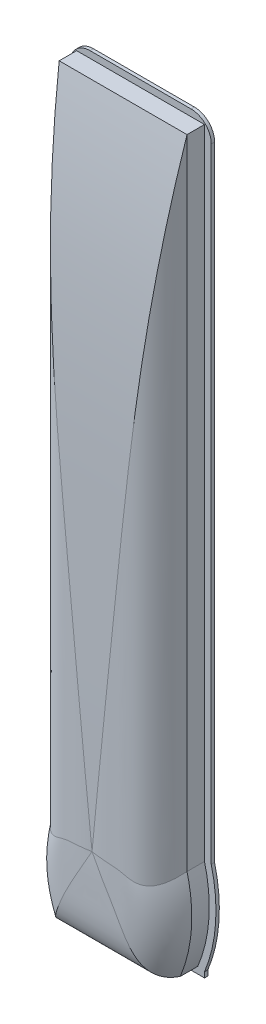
ISO-10303-21;
HEADER;
FILE_DESCRIPTION(('STEP AP214'),'2;1');
FILE_NAME('part.step','',(''),(''),'','','');
FILE_SCHEMA(('AUTOMOTIVE_DESIGN { 1 0 10303 214 1 1 1 1 }'));
ENDSEC;
DATA;
#1=APPLICATION_CONTEXT('core data for automotive mechanical design processes');
#2=APPLICATION_PROTOCOL_DEFINITION('international standard','automotive_design',2000,#1);
#3=PRODUCT_CONTEXT('',#1,'mechanical');
#4=PRODUCT('Part','Part','',(#3));
#5=PRODUCT_RELATED_PRODUCT_CATEGORY('part','',(#4));
#6=PRODUCT_DEFINITION_FORMATION('','',#4);
#7=PRODUCT_DEFINITION_CONTEXT('part definition',#1,'design');
#8=PRODUCT_DEFINITION('design','',#6,#7);
#9=PRODUCT_DEFINITION_SHAPE('','',#8);
#10=(LENGTH_UNIT() NAMED_UNIT(*) SI_UNIT(.MILLI.,.METRE.));
#11=(NAMED_UNIT(*) PLANE_ANGLE_UNIT() SI_UNIT($,.RADIAN.));
#12=(NAMED_UNIT(*) SI_UNIT($,.STERADIAN.) SOLID_ANGLE_UNIT());
#13=UNCERTAINTY_MEASURE_WITH_UNIT(LENGTH_MEASURE(1.E-05),#10,'distance_accuracy_value','');
#14=(GEOMETRIC_REPRESENTATION_CONTEXT(3) GLOBAL_UNCERTAINTY_ASSIGNED_CONTEXT((#13)) GLOBAL_UNIT_ASSIGNED_CONTEXT((#10,
#11,#12)) REPRESENTATION_CONTEXT('',''));
#15=CARTESIAN_POINT('',(0.,0.,0.));
#16=DIRECTION('',(0.,0.,1.));
#17=DIRECTION('',(1.,0.,0.));
#18=AXIS2_PLACEMENT_3D('',#15,#16,#17);
#19=CARTESIAN_POINT('',(-11.7976716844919,8.98505573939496,0.5));
#20=DIRECTION('',(0.,0.,1.));
#21=DIRECTION('',(1.,0.,0.));
#22=AXIS2_PLACEMENT_3D('',#19,#20,#21);
#23=PLANE('',#22);
#24=DIRECTION('',(1.,0.,0.));
#25=VECTOR('',#24,1.);
#26=CARTESIAN_POINT('',(-9.50000000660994,-0.500492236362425,0.5));
#27=LINE('',#26,#25);
#28=CARTESIAN_POINT('',(-9.50000000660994,-0.500492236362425,0.5));
#29=VERTEX_POINT('',#28);
#30=CARTESIAN_POINT('',(-2.50000000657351,-0.500492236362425,0.5));
#31=VERTEX_POINT('',#30);
#32=EDGE_CURVE('E215',#29,#31,#27,.T.);
#33=ORIENTED_EDGE('',*,*,#32,.T.);
#34=DIRECTION('',(0.,1.,0.));
#35=VECTOR('',#34,1.);
#36=CARTESIAN_POINT('',(-2.50000000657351,-0.500492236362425,0.5));
#37=LINE('',#36,#35);
#38=CARTESIAN_POINT('',(-2.50000000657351,-6.10438349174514E-10,0.5));
#39=VERTEX_POINT('',#38);
#40=EDGE_CURVE('E218',#31,#39,#37,.T.);
#41=ORIENTED_EDGE('',*,*,#40,.T.);
#42=DIRECTION('',(1.,0.,0.));
#43=VECTOR('',#42,1.);
#44=CARTESIAN_POINT('',(-2.50000000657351,-6.10438349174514E-10,0.5));
#45=LINE('',#44,#43);
#46=CARTESIAN_POINT('',(2.49999999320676,-6.10438349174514E-10,0.5));
#47=VERTEX_POINT('',#46);
#48=EDGE_CURVE('E222',#39,#47,#45,.T.);
#49=ORIENTED_EDGE('',*,*,#48,.T.);
#50=DIRECTION('',(0.,-1.,0.));
#51=VECTOR('',#50,1.);
#52=CARTESIAN_POINT('',(2.49999999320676,-6.10438349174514E-10,0.5));
#53=LINE('',#52,#51);
#54=CARTESIAN_POINT('',(2.49999999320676,-0.500492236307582,0.5));
#55=VERTEX_POINT('',#54);
#56=EDGE_CURVE('E225',#47,#55,#53,.T.);
#57=ORIENTED_EDGE('',*,*,#56,.T.);
#58=DIRECTION('',(1.,0.,0.));
#59=VECTOR('',#58,1.);
#60=CARTESIAN_POINT('',(2.49999999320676,-0.500492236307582,0.5));
#61=LINE('',#60,#59);
#62=CARTESIAN_POINT('',(9.49999999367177,-0.500492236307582,0.5));
#63=VERTEX_POINT('',#62);
#64=EDGE_CURVE('E228',#55,#63,#61,.T.);
#65=ORIENTED_EDGE('',*,*,#64,.T.);
#66=DIRECTION('',(0.,1.,0.));
#67=VECTOR('',#66,1.);
#68=CARTESIAN_POINT('',(9.49999999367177,-0.500492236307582,0.5));
#69=LINE('',#68,#67);
#70=CARTESIAN_POINT('',(9.49999999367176,0.301209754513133,0.5));
#71=VERTEX_POINT('',#70);
#72=EDGE_CURVE('E231',#63,#71,#69,.T.);
#73=ORIENTED_EDGE('',*,*,#72,.T.);
#74=CARTESIAN_POINT('',(-11.7976716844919,8.98505573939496,0.5));
#75=DIRECTION('',(0.,0.,1.));
#76=DIRECTION('',(1.,0.,0.));
#77=AXIS2_PLACEMENT_3D('',#74,#75,#76);
#78=CIRCLE('',#77,23.0000000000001);
#79=CARTESIAN_POINT('',(10.4999999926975,14.6254314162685,0.5));
#80=VERTEX_POINT('',#79);
#81=EDGE_CURVE('E234',#71,#80,#78,.T.);
#82=ORIENTED_EDGE('',*,*,#81,.T.);
#83=DIRECTION('',(0.,1.,0.));
#84=VECTOR('',#83,1.);
#85=CARTESIAN_POINT('',(10.4999999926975,14.6254314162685,0.5));
#86=LINE('',#85,#84);
#87=CARTESIAN_POINT('',(10.4999999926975,107.344773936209,0.5));
#88=VERTEX_POINT('',#87);
#89=EDGE_CURVE('E237',#80,#88,#86,.T.);
#90=ORIENTED_EDGE('',*,*,#89,.T.);
#91=CARTESIAN_POINT('',(10.4999999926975,107.344773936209,0.5));
#92=CARTESIAN_POINT('',(10.4997864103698,107.941944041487,0.5));
#93=CARTESIAN_POINT('',(10.2717787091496,108.49323926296,0.5));
#94=CARTESIAN_POINT('',(10.0440329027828,109.043901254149,0.5));
#95=CARTESIAN_POINT('',(9.62242700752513,109.46637867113,0.5));
#96=CARTESIAN_POINT('',(9.20168100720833,109.887994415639,0.5));
#97=CARTESIAN_POINT('',(8.65082789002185,110.117078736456,0.5));
#98=CARTESIAN_POINT('',(8.09910944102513,110.346522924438,0.5));
#99=CARTESIAN_POINT('',(7.49999999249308,110.346742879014,0.5));
#100=B_SPLINE_CURVE_WITH_KNOTS('',2,(#91,#92,#93,#94,#95,#96,#97,#98,#99),.UNSPECIFIED.,.F.,.F.,
(3,2,2,2,3),(0.,0.25,0.5,0.75,1.),.UNSPECIFIED.);
#101=CARTESIAN_POINT('',(7.49999999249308,110.346742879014,0.5));
#102=VERTEX_POINT('',#101);
#103=EDGE_CURVE('E240',#88,#102,#100,.T.);
#104=ORIENTED_EDGE('',*,*,#103,.T.);
#105=DIRECTION('',(-1.,0.,0.));
#106=VECTOR('',#105,1.);
#107=CARTESIAN_POINT('',(7.49999999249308,110.346742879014,0.5));
#108=LINE('',#107,#106);
#109=CARTESIAN_POINT('',(-7.50000000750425,110.346742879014,0.5));
#110=VERTEX_POINT('',#109);
#111=EDGE_CURVE('E246',#102,#110,#108,.T.);
#112=ORIENTED_EDGE('',*,*,#111,.T.);
#113=CARTESIAN_POINT('',(-7.50000000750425,110.346742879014,0.5));
#114=CARTESIAN_POINT('',(-8.09714248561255,110.346528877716,0.5));
#115=CARTESIAN_POINT('',(-8.64835890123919,110.118103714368,0.5));
#116=CARTESIAN_POINT('',(-9.19874364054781,109.890023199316,0.5));
#117=CARTESIAN_POINT('',(-9.62091052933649,109.467896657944,0.5));
#118=CARTESIAN_POINT('',(-10.0420060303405,109.046841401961,0.5));
#119=CARTESIAN_POINT('',(-10.2707543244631,108.495711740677,0.5));
#120=CARTESIAN_POINT('',(-10.4997804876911,107.943912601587,0.5));
#121=CARTESIAN_POINT('',(-10.5000000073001,107.344773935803,0.5));
#122=B_SPLINE_CURVE_WITH_KNOTS('',2,(#113,#114,#115,#116,#117,#118,#119,#120,#121),
.UNSPECIFIED.,.F.,.F.,(3,2,2,2,3),(0.,0.25,0.5,0.75,1.),.UNSPECIFIED.);
#123=CARTESIAN_POINT('',(-10.5000000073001,107.344773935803,0.5));
#124=VERTEX_POINT('',#123);
#125=EDGE_CURVE('E318',#110,#124,#122,.T.);
#126=ORIENTED_EDGE('',*,*,#125,.T.);
#127=DIRECTION('',(0.,-1.,0.));
#128=VECTOR('',#127,1.);
#129=CARTESIAN_POINT('',(-10.5000000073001,107.344773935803,0.5));
#130=LINE('',#129,#128);
#131=CARTESIAN_POINT('',(-10.5000000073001,14.6254314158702,0.5));
#132=VERTEX_POINT('',#131);
#133=EDGE_CURVE('E324',#124,#132,#130,.T.);
#134=ORIENTED_EDGE('',*,*,#133,.T.);
#135=CARTESIAN_POINT('',(11.7976716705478,8.98505574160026,0.5));
#136=DIRECTION('',(0.,0.,1.));
#137=DIRECTION('',(1.,0.,0.));
#138=AXIS2_PLACEMENT_3D('',#135,#136,#137);
#139=CIRCLE('',#138,23.);
#140=CARTESIAN_POINT('',(-9.50000000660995,0.30120975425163,0.5));
#141=VERTEX_POINT('',#140);
#142=EDGE_CURVE('E330',#132,#141,#139,.T.);
#143=ORIENTED_EDGE('',*,*,#142,.T.);
#144=DIRECTION('',(0.,-1.,0.));
#145=VECTOR('',#144,1.);
#146=CARTESIAN_POINT('',(-9.50000000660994,0.301209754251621,0.5));
#147=LINE('',#146,#145);
#148=EDGE_CURVE('E333',#141,#29,#147,.T.);
#149=ORIENTED_EDGE('',*,*,#148,.T.);
#150=EDGE_LOOP('',(#33,#41,#49,#57,#65,#73,#82,#90,#104,#112,#126,#134,#143,#149));
#151=FACE_BOUND('',#150,.T.);
#152=CARTESIAN_POINT('',(11.7976716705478,8.98505574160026,0.5));
#153=DIRECTION('',(0.,0.,1.));
#154=DIRECTION('',(1.,0.,0.));
#155=AXIS2_PLACEMENT_3D('',#152,#153,#154);
#156=CIRCLE('',#155,22.);
#157=CARTESIAN_POINT('',(-9.50000000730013,14.4995077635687,0.5));
#158=VERTEX_POINT('',#157);
#159=CARTESIAN_POINT('',(-8.50000000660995,0.499507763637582,0.5));
#160=VERTEX_POINT('',#159);
#161=EDGE_CURVE('E178',#158,#160,#156,.T.);
#162=ORIENTED_EDGE('',*,*,#161,.F.);
#163=DIRECTION('',(0.,-1.,0.));
#164=VECTOR('',#163,1.);
#165=CARTESIAN_POINT('',(-9.50000000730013,109.346742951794,0.5));
#166=LINE('',#165,#164);
#167=CARTESIAN_POINT('',(-9.50000000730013,109.346742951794,0.5));
#168=VERTEX_POINT('',#167);
#169=EDGE_CURVE('E175',#168,#158,#166,.T.);
#170=ORIENTED_EDGE('',*,*,#169,.F.);
#171=DIRECTION('',(-1.,4.28120476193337E-09,0.));
#172=VECTOR('',#171,1.);
#173=CARTESIAN_POINT('',(9.50000005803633,109.346742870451,0.5));
#174=LINE('',#173,#172);
#175=CARTESIAN_POINT('',(9.50000005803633,109.346742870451,0.5));
#176=VERTEX_POINT('',#175);
#177=EDGE_CURVE('E212',#176,#168,#174,.T.);
#178=ORIENTED_EDGE('',*,*,#177,.F.);
#179=DIRECTION('',(6.88884424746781E-10,1.,0.));
#180=VECTOR('',#179,1.);
#181=CARTESIAN_POINT('',(9.49999999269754,14.4995077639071,0.5));
#182=LINE('',#181,#180);
#183=CARTESIAN_POINT('',(9.49999999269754,14.4995077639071,0.5));
#184=VERTEX_POINT('',#183);
#185=EDGE_CURVE('E210',#184,#176,#182,.T.);
#186=ORIENTED_EDGE('',*,*,#185,.F.);
#187=CARTESIAN_POINT('',(-11.7976716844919,8.98505573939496,0.5));
#188=DIRECTION('',(0.,0.,1.));
#189=DIRECTION('',(1.,0.,0.));
#190=AXIS2_PLACEMENT_3D('',#187,#188,#189);
#191=CIRCLE('',#190,22.0000000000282);
#192=CARTESIAN_POINT('',(8.49999999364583,0.499507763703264,0.5));
#193=VERTEX_POINT('',#192);
#194=EDGE_CURVE('E208',#193,#184,#191,.T.);
#195=ORIENTED_EDGE('',*,*,#194,.F.);
#196=DIRECTION('',(1.,3.22567365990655E-12,0.));
#197=VECTOR('',#196,1.);
#198=CARTESIAN_POINT('',(-8.50000000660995,0.499507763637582,0.5));
#199=LINE('',#198,#197);
#200=EDGE_CURVE('E149',#160,#193,#199,.T.);
#201=ORIENTED_EDGE('',*,*,#200,.F.);
#202=EDGE_LOOP('',(#162,#170,#178,#186,#195,#201));
#203=FACE_BOUND('',#202,.T.);
#204=ADVANCED_FACE('F89',(#151,#203),#23,.T.);
#205=CARTESIAN_POINT('',(-9.50000000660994,-0.500492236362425,0.5));
#206=DIRECTION('',(0.,1.,0.));
#207=DIRECTION('',(0.,0.,1.));
#208=AXIS2_PLACEMENT_3D('',#205,#206,#207);
#209=PLANE('',#208);
#210=DIRECTION('',(1.,0.,0.));
#211=VECTOR('',#210,1.);
#212=CARTESIAN_POINT('',(-9.50000000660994,-0.500492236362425,0.));
#213=LINE('',#212,#211);
#214=CARTESIAN_POINT('',(-9.50000000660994,-0.500492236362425,0.));
#215=VERTEX_POINT('',#214);
#216=CARTESIAN_POINT('',(-2.50000000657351,-0.500492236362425,0.));
#217=VERTEX_POINT('',#216);
#218=EDGE_CURVE('E336',#215,#217,#213,.T.);
#219=ORIENTED_EDGE('',*,*,#218,.T.);
#220=DIRECTION('',(0.,0.,-1.));
#221=VECTOR('',#220,1.);
#222=CARTESIAN_POINT('',(-2.50000000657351,-0.500492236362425,0.5));
#223=LINE('',#222,#221);
#224=EDGE_CURVE('E13',#31,#217,#223,.T.);
#225=ORIENTED_EDGE('',*,*,#224,.F.);
#226=ORIENTED_EDGE('',*,*,#32,.F.);
#227=DIRECTION('',(0.,0.,-1.));
#228=VECTOR('',#227,1.);
#229=CARTESIAN_POINT('',(-9.50000000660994,-0.500492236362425,0.5));
#230=LINE('',#229,#228);
#231=EDGE_CURVE('E335',#29,#215,#230,.T.);
#232=ORIENTED_EDGE('',*,*,#231,.T.);
#233=EDGE_LOOP('',(#219,#225,#226,#232));
#234=FACE_BOUND('',#233,.T.);
#235=ADVANCED_FACE('F91',(#234),#209,.F.);
#236=CARTESIAN_POINT('',(-2.50000000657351,-0.500492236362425,0.5));
#237=DIRECTION('',(-1.,0.,0.));
#238=DIRECTION('',(0.,-1.,0.));
#239=AXIS2_PLACEMENT_3D('',#236,#237,#238);
#240=PLANE('',#239);
#241=DIRECTION('',(0.,1.,0.));
#242=VECTOR('',#241,1.);
#243=CARTESIAN_POINT('',(-2.50000000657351,-0.500492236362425,0.));
#244=LINE('',#243,#242);
#245=CARTESIAN_POINT('',(-2.50000000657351,-6.10438349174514E-10,0.));
#246=VERTEX_POINT('',#245);
#247=EDGE_CURVE('E339',#217,#246,#244,.T.);
#248=ORIENTED_EDGE('',*,*,#247,.T.);
#249=DIRECTION('',(0.,0.,-1.));
#250=VECTOR('',#249,1.);
#251=CARTESIAN_POINT('',(-2.50000000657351,-6.10438349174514E-10,0.5));
#252=LINE('',#251,#250);
#253=EDGE_CURVE('E99',#39,#246,#252,.T.);
#254=ORIENTED_EDGE('',*,*,#253,.F.);
#255=ORIENTED_EDGE('',*,*,#40,.F.);
#256=ORIENTED_EDGE('',*,*,#224,.T.);
#257=EDGE_LOOP('',(#248,#254,#255,#256));
#258=FACE_BOUND('',#257,.T.);
#259=ADVANCED_FACE('F281',(#258),#240,.F.);
#260=CARTESIAN_POINT('',(-2.50000000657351,-6.10438349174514E-10,0.5));
#261=DIRECTION('',(0.,1.,0.));
#262=DIRECTION('',(0.,0.,1.));
#263=AXIS2_PLACEMENT_3D('',#260,#261,#262);
#264=PLANE('',#263);
#265=DIRECTION('',(1.,0.,0.));
#266=VECTOR('',#265,1.);
#267=CARTESIAN_POINT('',(-2.50000000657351,-6.10438349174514E-10,0.));
#268=LINE('',#267,#266);
#269=CARTESIAN_POINT('',(2.49999999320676,-6.10438349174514E-10,0.));
#270=VERTEX_POINT('',#269);
#271=EDGE_CURVE('E342',#246,#270,#268,.T.);
#272=ORIENTED_EDGE('',*,*,#271,.T.);
#273=DIRECTION('',(0.,0.,-1.));
#274=VECTOR('',#273,1.);
#275=CARTESIAN_POINT('',(2.49999999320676,-6.10438349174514E-10,0.5));
#276=LINE('',#275,#274);
#277=EDGE_CURVE('E419',#47,#270,#276,.T.);
#278=ORIENTED_EDGE('',*,*,#277,.F.);
#279=ORIENTED_EDGE('',*,*,#48,.F.);
#280=ORIENTED_EDGE('',*,*,#253,.T.);
#281=EDGE_LOOP('',(#272,#278,#279,#280));
#282=FACE_BOUND('',#281,.T.);
#283=ADVANCED_FACE('F278',(#282),#264,.F.);
#284=CARTESIAN_POINT('',(2.49999999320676,-6.10438349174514E-10,0.5));
#285=DIRECTION('',(1.,0.,0.));
#286=DIRECTION('',(0.,0.,-1.));
#287=AXIS2_PLACEMENT_3D('',#284,#285,#286);
#288=PLANE('',#287);
#289=DIRECTION('',(0.,-1.,0.));
#290=VECTOR('',#289,1.);
#291=CARTESIAN_POINT('',(2.49999999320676,-6.10438349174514E-10,0.));
#292=LINE('',#291,#290);
#293=CARTESIAN_POINT('',(2.49999999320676,-0.500492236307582,0.));
#294=VERTEX_POINT('',#293);
#295=EDGE_CURVE('E345',#270,#294,#292,.T.);
#296=ORIENTED_EDGE('',*,*,#295,.T.);
#297=DIRECTION('',(0.,0.,-1.));
#298=VECTOR('',#297,1.);
#299=CARTESIAN_POINT('',(2.49999999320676,-0.500492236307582,0.5));
#300=LINE('',#299,#298);
#301=EDGE_CURVE('E416',#55,#294,#300,.T.);
#302=ORIENTED_EDGE('',*,*,#301,.F.);
#303=ORIENTED_EDGE('',*,*,#56,.F.);
#304=ORIENTED_EDGE('',*,*,#277,.T.);
#305=EDGE_LOOP('',(#296,#302,#303,#304));
#306=FACE_BOUND('',#305,.T.);
#307=ADVANCED_FACE('F274',(#306),#288,.F.);
#308=CARTESIAN_POINT('',(2.49999999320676,-0.500492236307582,0.5));
#309=DIRECTION('',(0.,1.,0.));
#310=DIRECTION('',(0.,0.,1.));
#311=AXIS2_PLACEMENT_3D('',#308,#309,#310);
#312=PLANE('',#311);
#313=DIRECTION('',(1.,0.,0.));
#314=VECTOR('',#313,1.);
#315=CARTESIAN_POINT('',(2.49999999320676,-0.500492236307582,0.));
#316=LINE('',#315,#314);
#317=CARTESIAN_POINT('',(9.49999999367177,-0.500492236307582,0.));
#318=VERTEX_POINT('',#317);
#319=EDGE_CURVE('E348',#294,#318,#316,.T.);
#320=ORIENTED_EDGE('',*,*,#319,.T.);
#321=DIRECTION('',(0.,0.,-1.));
#322=VECTOR('',#321,1.);
#323=CARTESIAN_POINT('',(9.49999999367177,-0.500492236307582,0.5));
#324=LINE('',#323,#322);
#325=EDGE_CURVE('E413',#63,#318,#324,.T.);
#326=ORIENTED_EDGE('',*,*,#325,.F.);
#327=ORIENTED_EDGE('',*,*,#64,.F.);
#328=ORIENTED_EDGE('',*,*,#301,.T.);
#329=EDGE_LOOP('',(#320,#326,#327,#328));
#330=FACE_BOUND('',#329,.T.);
#331=ADVANCED_FACE('F270',(#330),#312,.F.);
#332=CARTESIAN_POINT('',(9.49999999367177,-0.500492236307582,0.5));
#333=DIRECTION('',(-1.,0.,0.));
#334=DIRECTION('',(0.,-1.,0.));
#335=AXIS2_PLACEMENT_3D('',#332,#333,#334);
#336=PLANE('',#335);
#337=DIRECTION('',(0.,1.,0.));
#338=VECTOR('',#337,1.);
#339=CARTESIAN_POINT('',(9.49999999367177,-0.500492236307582,0.));
#340=LINE('',#339,#338);
#341=CARTESIAN_POINT('',(9.49999999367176,0.301209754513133,0.));
#342=VERTEX_POINT('',#341);
#343=EDGE_CURVE('E351',#318,#342,#340,.T.);
#344=ORIENTED_EDGE('',*,*,#343,.T.);
#345=DIRECTION('',(0.,0.,-1.));
#346=VECTOR('',#345,1.);
#347=CARTESIAN_POINT('',(9.49999999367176,0.301209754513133,0.5));
#348=LINE('',#347,#346);
#349=EDGE_CURVE('E410',#71,#342,#348,.T.);
#350=ORIENTED_EDGE('',*,*,#349,.F.);
#351=ORIENTED_EDGE('',*,*,#72,.F.);
#352=ORIENTED_EDGE('',*,*,#325,.T.);
#353=EDGE_LOOP('',(#344,#350,#351,#352));
#354=FACE_BOUND('',#353,.T.);
#355=ADVANCED_FACE('F266',(#354),#336,.F.);
#356=CARTESIAN_POINT('',(-11.7976716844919,8.98505573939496,0.5));
#357=DIRECTION('',(0.,0.,-1.));
#358=DIRECTION('',(-1.,0.,0.));
#359=AXIS2_PLACEMENT_3D('',#356,#357,#358);
#360=CYLINDRICAL_SURFACE('',#359,23.0000000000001);
#361=CARTESIAN_POINT('',(-11.7976716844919,8.98505573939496,0.));
#362=DIRECTION('',(0.,0.,1.));
#363=DIRECTION('',(1.,0.,0.));
#364=AXIS2_PLACEMENT_3D('',#361,#362,#363);
#365=CIRCLE('',#364,23.0000000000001);
#366=CARTESIAN_POINT('',(10.4999999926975,14.6254314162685,0.));
#367=VERTEX_POINT('',#366);
#368=EDGE_CURVE('E354',#342,#367,#365,.T.);
#369=ORIENTED_EDGE('',*,*,#368,.T.);
#370=DIRECTION('',(0.,0.,-1.));
#371=VECTOR('',#370,1.);
#372=CARTESIAN_POINT('',(10.4999999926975,14.6254314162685,0.5));
#373=LINE('',#372,#371);
#374=EDGE_CURVE('E407',#80,#367,#373,.T.);
#375=ORIENTED_EDGE('',*,*,#374,.F.);
#376=ORIENTED_EDGE('',*,*,#81,.F.);
#377=ORIENTED_EDGE('',*,*,#349,.T.);
#378=EDGE_LOOP('',(#369,#375,#376,#377));
#379=FACE_BOUND('',#378,.T.);
#380=ADVANCED_FACE('F262',(#379),#360,.T.);
#381=CARTESIAN_POINT('',(10.4999999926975,14.6254314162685,0.5));
#382=DIRECTION('',(-1.,0.,0.));
#383=DIRECTION('',(0.,-1.,0.));
#384=AXIS2_PLACEMENT_3D('',#381,#382,#383);
#385=PLANE('',#384);
#386=DIRECTION('',(0.,1.,0.));
#387=VECTOR('',#386,1.);
#388=CARTESIAN_POINT('',(10.4999999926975,14.6254314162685,0.));
#389=LINE('',#388,#387);
#390=CARTESIAN_POINT('',(10.4999999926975,107.344773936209,0.));
#391=VERTEX_POINT('',#390);
#392=EDGE_CURVE('E357',#367,#391,#389,.T.);
#393=ORIENTED_EDGE('',*,*,#392,.T.);
#394=DIRECTION('',(0.,0.,-1.));
#395=VECTOR('',#394,1.);
#396=CARTESIAN_POINT('',(10.4999999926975,107.344773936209,0.5));
#397=LINE('',#396,#395);
#398=EDGE_CURVE('E404',#88,#391,#397,.T.);
#399=ORIENTED_EDGE('',*,*,#398,.F.);
#400=ORIENTED_EDGE('',*,*,#89,.F.);
#401=ORIENTED_EDGE('',*,*,#374,.T.);
#402=EDGE_LOOP('',(#393,#399,#400,#401));
#403=FACE_BOUND('',#402,.T.);
#404=ADVANCED_FACE('F257',(#403),#385,.F.);
#405=DIRECTION('',(0.,0.,-1.));
#406=VECTOR('',#405,1.);
#407=SURFACE_OF_LINEAR_EXTRUSION('',#100,#406);
#408=CARTESIAN_POINT('',(10.4999999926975,107.344773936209,0.));
#409=CARTESIAN_POINT('',(10.4997864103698,107.941944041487,0.));
#410=CARTESIAN_POINT('',(10.2717787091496,108.49323926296,0.));
#411=CARTESIAN_POINT('',(10.0440329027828,109.043901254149,0.));
#412=CARTESIAN_POINT('',(9.62242700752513,109.46637867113,0.));
#413=CARTESIAN_POINT('',(9.20168100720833,109.887994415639,0.));
#414=CARTESIAN_POINT('',(8.65082789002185,110.117078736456,0.));
#415=CARTESIAN_POINT('',(8.09910944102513,110.346522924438,0.));
#416=CARTESIAN_POINT('',(7.49999999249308,110.346742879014,0.));
#417=B_SPLINE_CURVE_WITH_KNOTS('',2,(#408,#409,#410,#411,#412,#413,#414,#415,#416),
.UNSPECIFIED.,.F.,.F.,(3,2,2,2,3),(0.,0.25,0.5,0.75,1.),.UNSPECIFIED.);
#418=CARTESIAN_POINT('',(7.49999999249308,110.346742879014,0.));
#419=VERTEX_POINT('',#418);
#420=EDGE_CURVE('E360',#391,#419,#417,.T.);
#421=ORIENTED_EDGE('',*,*,#420,.T.);
#422=DIRECTION('',(0.,0.,-1.));
#423=VECTOR('',#422,1.);
#424=CARTESIAN_POINT('',(7.49999999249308,110.346742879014,0.5));
#425=LINE('',#424,#423);
#426=EDGE_CURVE('E401',#102,#419,#425,.T.);
#427=ORIENTED_EDGE('',*,*,#426,.F.);
#428=ORIENTED_EDGE('',*,*,#103,.F.);
#429=ORIENTED_EDGE('',*,*,#398,.T.);
#430=EDGE_LOOP('',(#421,#427,#428,#429));
#431=FACE_BOUND('',#430,.T.);
#432=ADVANCED_FACE('F252',(#431),#407,.F.);
#433=CARTESIAN_POINT('',(7.49999999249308,110.346742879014,0.5));
#434=DIRECTION('',(0.,-1.,0.));
#435=DIRECTION('',(0.,0.,-1.));
#436=AXIS2_PLACEMENT_3D('',#433,#434,#435);
#437=PLANE('',#436);
#438=DIRECTION('',(-1.,0.,0.));
#439=VECTOR('',#438,1.);
#440=CARTESIAN_POINT('',(7.49999999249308,110.346742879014,0.));
#441=LINE('',#440,#439);
#442=CARTESIAN_POINT('',(-7.50000000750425,110.346742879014,0.));
#443=VERTEX_POINT('',#442);
#444=EDGE_CURVE('E365',#419,#443,#441,.T.);
#445=ORIENTED_EDGE('',*,*,#444,.T.);
#446=DIRECTION('',(0.,0.,-1.));
#447=VECTOR('',#446,1.);
#448=CARTESIAN_POINT('',(-7.50000000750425,110.346742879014,0.5));
#449=LINE('',#448,#447);
#450=EDGE_CURVE('E398',#110,#443,#449,.T.);
#451=ORIENTED_EDGE('',*,*,#450,.F.);
#452=ORIENTED_EDGE('',*,*,#111,.F.);
#453=ORIENTED_EDGE('',*,*,#426,.T.);
#454=EDGE_LOOP('',(#445,#451,#452,#453));
#455=FACE_BOUND('',#454,.T.);
#456=ADVANCED_FACE('F256',(#455),#437,.F.);
#457=DIRECTION('',(0.,0.,-1.));
#458=VECTOR('',#457,1.);
#459=SURFACE_OF_LINEAR_EXTRUSION('',#122,#458);
#460=CARTESIAN_POINT('',(-7.50000000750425,110.346742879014,0.));
#461=CARTESIAN_POINT('',(-8.09714248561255,110.346528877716,0.));
#462=CARTESIAN_POINT('',(-8.64835890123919,110.118103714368,0.));
#463=CARTESIAN_POINT('',(-9.19874364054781,109.890023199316,0.));
#464=CARTESIAN_POINT('',(-9.62091052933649,109.467896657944,0.));
#465=CARTESIAN_POINT('',(-10.0420060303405,109.046841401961,0.));
#466=CARTESIAN_POINT('',(-10.2707543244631,108.495711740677,0.));
#467=CARTESIAN_POINT('',(-10.4997804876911,107.943912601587,0.));
#468=CARTESIAN_POINT('',(-10.5000000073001,107.344773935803,0.));
#469=B_SPLINE_CURVE_WITH_KNOTS('',2,(#460,#461,#462,#463,#464,#465,#466,#467,#468),
.UNSPECIFIED.,.F.,.F.,(3,2,2,2,3),(0.,0.25,0.5,0.75,1.),.UNSPECIFIED.);
#470=CARTESIAN_POINT('',(-10.5000000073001,107.344773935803,0.));
#471=VERTEX_POINT('',#470);
#472=EDGE_CURVE('E371',#443,#471,#469,.T.);
#473=ORIENTED_EDGE('',*,*,#472,.T.);
#474=DIRECTION('',(0.,0.,-1.));
#475=VECTOR('',#474,1.);
#476=CARTESIAN_POINT('',(-10.5000000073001,107.344773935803,0.5));
#477=LINE('',#476,#475);
#478=EDGE_CURVE('E395',#124,#471,#477,.T.);
#479=ORIENTED_EDGE('',*,*,#478,.F.);
#480=ORIENTED_EDGE('',*,*,#125,.F.);
#481=ORIENTED_EDGE('',*,*,#450,.T.);
#482=EDGE_LOOP('',(#473,#479,#480,#481));
#483=FACE_BOUND('',#482,.T.);
#484=ADVANCED_FACE('F314',(#483),#459,.F.);
#485=CARTESIAN_POINT('',(-10.5000000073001,107.344773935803,0.5));
#486=DIRECTION('',(1.,0.,0.));
#487=DIRECTION('',(0.,1.,0.));
#488=AXIS2_PLACEMENT_3D('',#485,#486,#487);
#489=PLANE('',#488);
#490=DIRECTION('',(0.,-1.,0.));
#491=VECTOR('',#490,1.);
#492=CARTESIAN_POINT('',(-10.5000000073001,107.344773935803,0.));
#493=LINE('',#492,#491);
#494=CARTESIAN_POINT('',(-10.5000000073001,14.6254314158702,0.));
#495=VERTEX_POINT('',#494);
#496=EDGE_CURVE('E376',#471,#495,#493,.T.);
#497=ORIENTED_EDGE('',*,*,#496,.T.);
#498=DIRECTION('',(0.,0.,-1.));
#499=VECTOR('',#498,1.);
#500=CARTESIAN_POINT('',(-10.5000000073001,14.6254314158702,0.5));
#501=LINE('',#500,#499);
#502=EDGE_CURVE('E392',#132,#495,#501,.T.);
#503=ORIENTED_EDGE('',*,*,#502,.F.);
#504=ORIENTED_EDGE('',*,*,#133,.F.);
#505=ORIENTED_EDGE('',*,*,#478,.T.);
#506=EDGE_LOOP('',(#497,#503,#504,#505));
#507=FACE_BOUND('',#506,.T.);
#508=ADVANCED_FACE('F311',(#507),#489,.F.);
#509=CARTESIAN_POINT('',(11.7976716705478,8.98505574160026,0.5));
#510=DIRECTION('',(0.,0.,-1.));
#511=DIRECTION('',(-1.,0.,0.));
#512=AXIS2_PLACEMENT_3D('',#509,#510,#511);
#513=CYLINDRICAL_SURFACE('',#512,23.);
#514=CARTESIAN_POINT('',(11.7976716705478,8.98505574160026,0.));
#515=DIRECTION('',(0.,0.,1.));
#516=DIRECTION('',(1.,0.,0.));
#517=AXIS2_PLACEMENT_3D('',#514,#515,#516);
#518=CIRCLE('',#517,23.);
#519=CARTESIAN_POINT('',(-9.50000000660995,0.30120975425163,0.));
#520=VERTEX_POINT('',#519);
#521=EDGE_CURVE('E382',#495,#520,#518,.T.);
#522=ORIENTED_EDGE('',*,*,#521,.T.);
#523=DIRECTION('',(0.,0.,-1.));
#524=VECTOR('',#523,1.);
#525=CARTESIAN_POINT('',(-9.50000000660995,0.30120975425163,0.5));
#526=LINE('',#525,#524);
#527=EDGE_CURVE('E389',#141,#520,#526,.T.);
#528=ORIENTED_EDGE('',*,*,#527,.F.);
#529=ORIENTED_EDGE('',*,*,#142,.F.);
#530=ORIENTED_EDGE('',*,*,#502,.T.);
#531=EDGE_LOOP('',(#522,#528,#529,#530));
#532=FACE_BOUND('',#531,.T.);
#533=ADVANCED_FACE('F307',(#532),#513,.T.);
#534=CARTESIAN_POINT('',(-9.50000000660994,0.301209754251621,0.5));
#535=DIRECTION('',(1.,0.,0.));
#536=DIRECTION('',(0.,0.,-1.));
#537=AXIS2_PLACEMENT_3D('',#534,#535,#536);
#538=PLANE('',#537);
#539=DIRECTION('',(0.,-1.,0.));
#540=VECTOR('',#539,1.);
#541=CARTESIAN_POINT('',(-9.50000000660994,0.301209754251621,0.));
#542=LINE('',#541,#540);
#543=EDGE_CURVE('E219',#520,#215,#542,.T.);
#544=ORIENTED_EDGE('',*,*,#543,.T.);
#545=ORIENTED_EDGE('',*,*,#231,.F.);
#546=ORIENTED_EDGE('',*,*,#148,.F.);
#547=ORIENTED_EDGE('',*,*,#527,.T.);
#548=EDGE_LOOP('',(#544,#545,#546,#547));
#549=FACE_BOUND('',#548,.T.);
#550=ADVANCED_FACE('F303',(#549),#538,.F.);
#551=CARTESIAN_POINT('',(-11.7976716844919,8.98505573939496,0.));
#552=DIRECTION('',(0.,0.,1.));
#553=DIRECTION('',(1.,0.,0.));
#554=AXIS2_PLACEMENT_3D('',#551,#552,#553);
#555=PLANE('',#554);
#556=ORIENTED_EDGE('',*,*,#218,.F.);
#557=ORIENTED_EDGE('',*,*,#543,.F.);
#558=ORIENTED_EDGE('',*,*,#521,.F.);
#559=ORIENTED_EDGE('',*,*,#496,.F.);
#560=ORIENTED_EDGE('',*,*,#472,.F.);
#561=ORIENTED_EDGE('',*,*,#444,.F.);
#562=ORIENTED_EDGE('',*,*,#420,.F.);
#563=ORIENTED_EDGE('',*,*,#392,.F.);
#564=ORIENTED_EDGE('',*,*,#368,.F.);
#565=ORIENTED_EDGE('',*,*,#343,.F.);
#566=ORIENTED_EDGE('',*,*,#319,.F.);
#567=ORIENTED_EDGE('',*,*,#295,.F.);
#568=ORIENTED_EDGE('',*,*,#271,.F.);
#569=ORIENTED_EDGE('',*,*,#247,.F.);
#570=EDGE_LOOP('',(#556,#557,#558,#559,#560,#561,#562,#563,#564,#565,#566,#567,#568,#569));
#571=FACE_BOUND('',#570,.T.);
#572=ADVANCED_FACE('F300',(#571),#555,.F.);
#573=CARTESIAN_POINT('',(-9.50000000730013,109.346742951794,3.1));
#574=DIRECTION('',(1.,0.,0.));
#575=DIRECTION('',(0.,1.,0.));
#576=AXIS2_PLACEMENT_3D('',#573,#574,#575);
#577=PLANE('',#576);
#578=ORIENTED_EDGE('',*,*,#169,.T.);
#579=DIRECTION('',(0.,0.,-1.));
#580=VECTOR('',#579,1.);
#581=CARTESIAN_POINT('',(-9.50000000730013,14.4995077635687,3.1));
#582=LINE('',#581,#580);
#583=CARTESIAN_POINT('',(-9.50000000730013,14.4995077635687,3.1));
#584=VERTEX_POINT('',#583);
#585=EDGE_CURVE('E340',#584,#158,#582,.T.);
#586=ORIENTED_EDGE('',*,*,#585,.F.);
#587=DIRECTION('',(0.,1.,0.));
#588=VECTOR('',#587,1.);
#589=CARTESIAN_POINT('',(-9.50000000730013,109.346742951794,3.1));
#590=LINE('',#589,#588);
#591=CARTESIAN_POINT('',(-9.50000000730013,109.346742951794,3.1));
#592=VERTEX_POINT('',#591);
#593=EDGE_CURVE('E214',#592,#584,#590,.F.);
#594=ORIENTED_EDGE('',*,*,#593,.F.);
#595=DIRECTION('',(0.,0.,-1.));
#596=VECTOR('',#595,1.);
#597=CARTESIAN_POINT('',(-9.50000000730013,109.346742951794,3.1));
#598=LINE('',#597,#596);
#599=EDGE_CURVE('E428',#592,#168,#598,.T.);
#600=ORIENTED_EDGE('',*,*,#599,.T.);
#601=EDGE_LOOP('',(#578,#586,#594,#600));
#602=FACE_BOUND('',#601,.T.);
#603=ADVANCED_FACE('F298',(#602),#577,.F.);
#604=CARTESIAN_POINT('',(11.7976716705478,8.98505574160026,3.1));
#605=DIRECTION('',(0.,0.,-1.));
#606=DIRECTION('',(-1.,0.,0.));
#607=AXIS2_PLACEMENT_3D('',#604,#605,#606);
#608=CYLINDRICAL_SURFACE('',#607,22.);
#609=ORIENTED_EDGE('',*,*,#161,.T.);
#610=DIRECTION('',(0.,0.,-1.));
#611=VECTOR('',#610,1.);
#612=CARTESIAN_POINT('',(-8.50000000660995,0.499507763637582,3.1));
#613=LINE('',#612,#611);
#614=CARTESIAN_POINT('',(-8.50000000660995,0.499507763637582,3.1));
#615=VERTEX_POINT('',#614);
#616=EDGE_CURVE('E136',#615,#160,#613,.T.);
#617=ORIENTED_EDGE('',*,*,#616,.F.);
#618=CARTESIAN_POINT('',(-9.50000000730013,14.4995077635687,3.1));
#619=CARTESIAN_POINT('',(-9.58990118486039,14.152325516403,3.09998893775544));
#620=CARTESIAN_POINT('',(-9.67129846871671,13.8029419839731,3.09996777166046));
#621=CARTESIAN_POINT('',(-9.81692332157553,13.1006131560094,3.09994117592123));
#622=CARTESIAN_POINT('',(-9.88115081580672,12.7476678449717,3.0999357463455));
#623=CARTESIAN_POINT('',(-9.99227375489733,12.0390568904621,3.09997656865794));
#624=CARTESIAN_POINT('',(-10.0391690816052,11.6833912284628,3.1000228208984));
#625=CARTESIAN_POINT('',(-10.1155628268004,10.9697658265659,3.10005563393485));
#626=CARTESIAN_POINT('',(-10.1450403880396,10.6118038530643,3.10004212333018));
#627=CARTESIAN_POINT('',(-10.1864397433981,9.89487610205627,3.09999716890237));
#628=CARTESIAN_POINT('',(-10.1983619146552,9.53591034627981,3.09996572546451));
#629=CARTESIAN_POINT('',(-10.2046223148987,8.81782984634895,3.09995894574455));
#630=CARTESIAN_POINT('',(-10.1989611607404,8.45871510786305,3.09998360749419));
#631=CARTESIAN_POINT('',(-10.1736800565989,7.83081179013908,3.10002573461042));
#632=CARTESIAN_POINT('',(-10.1578990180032,7.56186186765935,3.10004345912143));
#633=CARTESIAN_POINT('',(-10.1164696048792,7.02470529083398,3.10003515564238));
#634=CARTESIAN_POINT('',(-10.0908207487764,6.75649867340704,3.10000912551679));
#635=CARTESIAN_POINT('',(-10.0296869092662,6.22118139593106,3.09997040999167));
#636=CARTESIAN_POINT('',(-9.99420090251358,5.95407085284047,3.09995772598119));
#637=CARTESIAN_POINT('',(-9.91344316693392,5.42133924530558,3.09995958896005));
#638=CARTESIAN_POINT('',(-9.86817161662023,5.15571815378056,3.09997413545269));
#639=CARTESIAN_POINT('',(-9.76798992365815,4.62678159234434,3.10002093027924));
#640=CARTESIAN_POINT('',(-9.7130969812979,4.36346287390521,3.10005314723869));
#641=CARTESIAN_POINT('',(-9.59369924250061,3.83902757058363,3.10006674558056));
#642=CARTESIAN_POINT('',(-9.52919421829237,3.57791103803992,3.10004812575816));
#643=CARTESIAN_POINT('',(-9.32142955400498,2.79858718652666,3.09997909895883));
#644=CARTESIAN_POINT('',(-9.16385858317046,2.2840797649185,3.09991551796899));
#645=CARTESIAN_POINT('',(-8.91302686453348,1.5608397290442,3.09993060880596));
#646=CARTESIAN_POINT('',(-8.83500368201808,1.3466869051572,3.09994843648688));
#647=CARTESIAN_POINT('',(-8.67240717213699,0.921080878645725,3.0999824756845));
#648=CARTESIAN_POINT('',(-8.58783919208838,0.709625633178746,3.09999868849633));
#649=CARTESIAN_POINT('',(-8.50000000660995,0.499507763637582,3.1));
#650=B_SPLINE_CURVE_WITH_KNOTS('',3,(#618,#619,#620,#621,#622,#623,#624,#625,#626,#627,#628,
#629,#630,#631,#632,#633,#634,#635,#636,#637,#638,#639,#640,#641,#642,#643,#644,#645,#646,#647,
#648,#649),.UNSPECIFIED.,.F.,.F.,(4,2,2,2,2,2,2,2,2,2,2,2,2,2,2,4),(0.,1.07579133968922,
2.15158736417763,3.2273907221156,4.30447972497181,5.38154558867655,6.45857366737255,
7.26664046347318,8.07474670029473,8.88293703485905,9.69111262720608,10.4978579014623,
11.3046222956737,12.9171584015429,13.6008463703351,14.2839815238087),.UNSPECIFIED.);
#651=EDGE_CURVE('E172',#584,#615,#650,.T.);
#652=ORIENTED_EDGE('',*,*,#651,.F.);
#653=ORIENTED_EDGE('',*,*,#585,.T.);
#654=EDGE_LOOP('',(#609,#617,#652,#653));
#655=FACE_BOUND('',#654,.T.);
#656=ADVANCED_FACE('F441',(#655),#608,.T.);
#657=CARTESIAN_POINT('',(-8.50000000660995,0.499507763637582,3.1));
#658=DIRECTION('',(-3.22567365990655E-12,1.,0.));
#659=DIRECTION('',(-1.,-3.22567365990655E-12,0.));
#660=AXIS2_PLACEMENT_3D('',#657,#658,#659);
#661=PLANE('',#660);
#662=ORIENTED_EDGE('',*,*,#200,.T.);
#663=DIRECTION('',(0.,0.,-1.));
#664=VECTOR('',#663,1.);
#665=CARTESIAN_POINT('',(8.49999999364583,0.499507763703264,3.1));
#666=LINE('',#665,#664);
#667=CARTESIAN_POINT('',(8.49999999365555,0.499507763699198,3.1));
#668=VERTEX_POINT('',#667);
#669=EDGE_CURVE('E142',#668,#193,#666,.T.);
#670=ORIENTED_EDGE('',*,*,#669,.F.);
#671=DIRECTION('',(-1.,-3.22567365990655E-12,0.));
#672=VECTOR('',#671,1.);
#673=CARTESIAN_POINT('',(-8.50000000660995,0.499507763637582,3.1));
#674=LINE('',#673,#672);
#675=EDGE_CURVE('E93',#615,#668,#674,.F.);
#676=ORIENTED_EDGE('',*,*,#675,.F.);
#677=ORIENTED_EDGE('',*,*,#616,.T.);
#678=EDGE_LOOP('',(#662,#670,#676,#677));
#679=FACE_BOUND('',#678,.T.);
#680=ADVANCED_FACE('F144',(#679),#661,.F.);
#681=CARTESIAN_POINT('',(-11.7976716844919,8.98505573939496,3.1));
#682=DIRECTION('',(0.,0.,-1.));
#683=DIRECTION('',(-1.,0.,0.));
#684=AXIS2_PLACEMENT_3D('',#681,#682,#683);
#685=CYLINDRICAL_SURFACE('',#684,22.0000000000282);
#686=ORIENTED_EDGE('',*,*,#194,.T.);
#687=DIRECTION('',(0.,0.,-1.));
#688=VECTOR('',#687,1.);
#689=CARTESIAN_POINT('',(9.49999999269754,14.4995077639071,3.1));
#690=LINE('',#689,#688);
#691=CARTESIAN_POINT('',(9.49999999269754,14.4995077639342,3.1));
#692=VERTEX_POINT('',#691);
#693=EDGE_CURVE('E153',#692,#184,#690,.T.);
#694=ORIENTED_EDGE('',*,*,#693,.F.);
#695=CARTESIAN_POINT('',(8.49999999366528,0.499507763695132,3.1));
#696=CARTESIAN_POINT('',(8.64177729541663,0.838621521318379,3.09997991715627));
#697=CARTESIAN_POINT('',(8.77504076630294,1.18129385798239,3.09995241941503));
#698=CARTESIAN_POINT('',(9.02424034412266,1.87288438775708,3.09992188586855));
#699=CARTESIAN_POINT('',(9.14017635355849,2.22180261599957,3.09991885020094));
#700=CARTESIAN_POINT('',(9.35442055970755,2.92501260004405,3.09997653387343));
#701=CARTESIAN_POINT('',(9.45272861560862,3.27930439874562,3.10003725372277));
#702=CARTESIAN_POINT('',(9.63159908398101,3.9928784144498,3.10006995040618));
#703=CARTESIAN_POINT('',(9.71213594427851,4.35216703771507,3.10004180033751));
#704=CARTESIAN_POINT('',(9.85507976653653,5.07432145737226,3.09998456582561));
#705=CARTESIAN_POINT('',(9.9174871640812,5.43718716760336,3.09995548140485));
#706=CARTESIAN_POINT('',(10.0240161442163,6.1655872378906,3.09996250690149));
#707=CARTESIAN_POINT('',(10.0681384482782,6.53112149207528,3.09999861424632));
#708=CARTESIAN_POINT('',(10.1292665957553,7.17241948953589,3.10003515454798));
#709=CARTESIAN_POINT('',(10.1502924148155,7.44780737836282,3.10004224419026));
#710=CARTESIAN_POINT('',(10.1819630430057,7.99919860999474,3.10002165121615));
#711=CARTESIAN_POINT('',(10.1926073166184,8.2752019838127,3.09999396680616));
#712=CARTESIAN_POINT('',(10.2034974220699,8.82744572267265,3.09996200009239));
#713=CARTESIAN_POINT('',(10.2037420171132,9.10368611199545,3.09995772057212));
#714=CARTESIAN_POINT('',(10.1938301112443,9.65597336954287,3.09997446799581));
#715=CARTESIAN_POINT('',(10.1836738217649,9.93202024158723,3.09999549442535));
#716=CARTESIAN_POINT('',(10.1530044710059,10.4829783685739,3.10003682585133));
#717=CARTESIAN_POINT('',(10.1325126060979,10.7578907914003,3.10005713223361));
#718=CARTESIAN_POINT('',(10.0812176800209,11.3067372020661,3.10004795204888));
#719=CARTESIAN_POINT('',(10.0504143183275,11.5806711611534,3.10001846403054));
#720=CARTESIAN_POINT('',(9.94261658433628,12.4001985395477,3.09995077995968));
#721=CARTESIAN_POINT('',(9.85021357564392,12.9438940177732,3.09993329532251));
#722=CARTESIAN_POINT('',(9.70199514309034,13.6535318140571,3.09996306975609));
#723=CARTESIAN_POINT('',(9.66439161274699,13.823459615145,3.09997422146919));
#724=CARTESIAN_POINT('',(9.58519005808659,14.1622596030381,3.09999281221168));
#725=CARTESIAN_POINT('',(9.54359477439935,14.3311324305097,3.10000025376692));
#726=CARTESIAN_POINT('',(9.49999999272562,14.4995077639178,3.1));
#727=B_SPLINE_CURVE_WITH_KNOTS('',3,(#695,#696,#697,#698,#699,#700,#701,#702,#703,#704,#705,
#706,#707,#708,#709,#710,#711,#712,#713,#714,#715,#716,#717,#718,#719,#720,#721,#722,#723,#724,
#725,#726),.UNSPECIFIED.,.F.,.F.,(4,2,2,2,2,2,2,2,2,2,2,2,2,2,2,4),(0.,1.10255782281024,
2.20512184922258,3.30769468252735,4.41184265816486,5.51596410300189,6.62004197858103,
7.44842616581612,8.27685308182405,9.10537851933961,9.93388711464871,10.7607034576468,
11.5875438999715,13.2400960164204,13.7621829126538,14.2839138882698),.UNSPECIFIED.);
#728=EDGE_CURVE('E156',#668,#692,#727,.T.);
#729=ORIENTED_EDGE('',*,*,#728,.F.);
#730=ORIENTED_EDGE('',*,*,#669,.T.);
#731=EDGE_LOOP('',(#686,#694,#729,#730));
#732=FACE_BOUND('',#731,.T.);
#733=ADVANCED_FACE('F157',(#732),#685,.T.);
#734=CARTESIAN_POINT('',(9.49999999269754,14.4995077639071,3.1));
#735=DIRECTION('',(-1.,6.88884424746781E-10,0.));
#736=DIRECTION('',(-6.88884424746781E-10,-1.,0.));
#737=AXIS2_PLACEMENT_3D('',#734,#735,#736);
#738=PLANE('',#737);
#739=ORIENTED_EDGE('',*,*,#185,.T.);
#740=DIRECTION('',(0.,0.,-1.));
#741=VECTOR('',#740,1.);
#742=CARTESIAN_POINT('',(9.50000005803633,109.346742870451,3.1));
#743=LINE('',#742,#741);
#744=CARTESIAN_POINT('',(9.50000005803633,109.346742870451,3.1));
#745=VERTEX_POINT('',#744);
#746=EDGE_CURVE('E108',#745,#176,#743,.T.);
#747=ORIENTED_EDGE('',*,*,#746,.F.);
#748=DIRECTION('',(-6.88884424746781E-10,-1.,0.));
#749=VECTOR('',#748,1.);
#750=CARTESIAN_POINT('',(9.49999999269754,14.4995077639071,3.1));
#751=LINE('',#750,#749);
#752=EDGE_CURVE('E164',#692,#745,#751,.F.);
#753=ORIENTED_EDGE('',*,*,#752,.F.);
#754=ORIENTED_EDGE('',*,*,#693,.T.);
#755=EDGE_LOOP('',(#739,#747,#753,#754));
#756=FACE_BOUND('',#755,.T.);
#757=ADVANCED_FACE('F473',(#756),#738,.F.);
#758=CARTESIAN_POINT('',(9.50000005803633,109.346742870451,3.1));
#759=DIRECTION('',(-4.28120476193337E-09,-1.,0.));
#760=DIRECTION('',(1.,-4.28120476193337E-09,0.));
#761=AXIS2_PLACEMENT_3D('',#758,#759,#760);
#762=PLANE('',#761);
#763=ORIENTED_EDGE('',*,*,#177,.T.);
#764=ORIENTED_EDGE('',*,*,#599,.F.);
#765=DIRECTION('',(1.,-4.28120476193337E-09,0.));
#766=VECTOR('',#765,1.);
#767=CARTESIAN_POINT('',(9.50000005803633,109.346742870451,3.1));
#768=LINE('',#767,#766);
#769=EDGE_CURVE('E431',#745,#592,#768,.F.);
#770=ORIENTED_EDGE('',*,*,#769,.F.);
#771=ORIENTED_EDGE('',*,*,#746,.T.);
#772=EDGE_LOOP('',(#763,#764,#770,#771));
#773=FACE_BOUND('',#772,.T.);
#774=ADVANCED_FACE('F465',(#773),#762,.F.);
#775=CARTESIAN_POINT('',(-8.50000000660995,0.499507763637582,3.1));
#776=CARTESIAN_POINT('',(-6.73350806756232,0.927903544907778,7.80994416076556));
#777=CARTESIAN_POINT('',(-4.9670161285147,5.87352780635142,7.64348660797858));
#778=CARTESIAN_POINT('',(-2.13368279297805,10.8642077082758,7.75706415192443));
#779=CARTESIAN_POINT('',(-1.06684139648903,12.7433596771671,7.79982976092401));
#780=CARTESIAN_POINT('',(0.,14.6254314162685,7.71429854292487));
#781=CARTESIAN_POINT('',(-7.79166667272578,0.499507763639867,3.1));
#782=CARTESIAN_POINT('',(-6.17238239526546,0.927903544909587,7.80994416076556));
#783=CARTESIAN_POINT('',(-4.55309811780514,5.87352780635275,7.64348660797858));
#784=CARTESIAN_POINT('',(-1.95587589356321,10.8642077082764,7.75706415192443));
#785=CARTESIAN_POINT('',(-0.977937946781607,12.7433596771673,7.79982976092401));
#786=CARTESIAN_POINT('',(0.,14.6254314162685,7.71429854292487));
#787=CARTESIAN_POINT('',(-6.37500000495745,0.499507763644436,3.1));
#788=CARTESIAN_POINT('',(-5.05013105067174,0.927903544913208,7.80994416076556));
#789=CARTESIAN_POINT('',(-3.72526209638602,5.87352780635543,7.64348660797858));
#790=CARTESIAN_POINT('',(-1.60026209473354,10.8642077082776,7.75706415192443));
#791=CARTESIAN_POINT('',(-0.800131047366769,12.7433596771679,7.79982976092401));
#792=CARTESIAN_POINT('',(0.,14.6254314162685,7.71429854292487));
#793=CARTESIAN_POINT('',(-4.25000000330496,0.499507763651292,3.1));
#794=CARTESIAN_POINT('',(-3.36675403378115,0.927903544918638,7.80994416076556));
#795=CARTESIAN_POINT('',(-2.48350806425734,5.87352780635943,7.64348660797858));
#796=CARTESIAN_POINT('',(-1.06684139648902,10.8642077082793,7.75706415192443));
#797=CARTESIAN_POINT('',(-0.533420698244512,12.7433596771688,7.79982976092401));
#798=CARTESIAN_POINT('',(0.,14.6254314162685,7.71429854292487));
#799=CARTESIAN_POINT('',(-2.12500000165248,0.499507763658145,3.1));
#800=CARTESIAN_POINT('',(-1.68337701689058,0.927903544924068,7.80994416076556));
#801=CARTESIAN_POINT('',(-1.24175403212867,5.87352780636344,7.64348660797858));
#802=CARTESIAN_POINT('',(-0.533420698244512,10.864207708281,7.75706415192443));
#803=CARTESIAN_POINT('',(-0.266710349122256,12.7433596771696,7.79982976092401));
#804=CARTESIAN_POINT('',(0.,14.6254314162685,7.71429854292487));
#805=CARTESIAN_POINT('',(-0.70833333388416,0.499507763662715,3.1));
#806=CARTESIAN_POINT('',(-0.561125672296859,0.927903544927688,7.80994416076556));
#807=CARTESIAN_POINT('',(-0.413918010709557,5.87352780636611,7.64348660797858));
#808=CARTESIAN_POINT('',(-0.177806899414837,10.8642077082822,7.75706415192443));
#809=CARTESIAN_POINT('',(-0.0889034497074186,12.7433596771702,7.79982976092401));
#810=CARTESIAN_POINT('',(0.,14.6254314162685,7.71429854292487));
#811=CARTESIAN_POINT('',(0.70833333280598,0.499507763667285,3.1));
#812=CARTESIAN_POINT('',(0.561125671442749,0.927903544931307,7.80994416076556));
#813=CARTESIAN_POINT('',(0.413918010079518,5.87352780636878,7.64348660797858));
#814=CARTESIAN_POINT('',(0.177806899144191,10.8642077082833,7.75706415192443));
#815=CARTESIAN_POINT('',(0.0889034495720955,12.7433596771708,7.79982976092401));
#816=CARTESIAN_POINT('',(0.,14.6254314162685,7.71429854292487));
#817=CARTESIAN_POINT('',(2.12499999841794,0.499507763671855,3.1));
#818=CARTESIAN_POINT('',(1.68337701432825,0.927903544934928,7.80994416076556));
#819=CARTESIAN_POINT('',(1.24175403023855,5.87352780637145,7.64348660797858));
#820=CARTESIAN_POINT('',(0.533420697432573,10.8642077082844,7.75706415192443));
#821=CARTESIAN_POINT('',(0.266710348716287,12.7433596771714,7.79982976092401));
#822=CARTESIAN_POINT('',(0.,14.6254314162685,7.71429854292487));
#823=CARTESIAN_POINT('',(4.24999999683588,0.499507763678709,3.1));
#824=CARTESIAN_POINT('',(3.36675402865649,0.927903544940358,7.80994416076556));
#825=CARTESIAN_POINT('',(2.48350806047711,5.87352780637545,7.64348660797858));
#826=CARTESIAN_POINT('',(1.06684139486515,10.8642077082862,7.75706415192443));
#827=CARTESIAN_POINT('',(0.533420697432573,12.7433596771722,7.79982976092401));
#828=CARTESIAN_POINT('',(0.,14.6254314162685,7.71429854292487));
#829=CARTESIAN_POINT('',(6.37499999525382,0.499507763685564,3.1));
#830=CARTESIAN_POINT('',(5.05013104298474,0.927903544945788,7.80994416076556));
#831=CARTESIAN_POINT('',(3.72526209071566,5.87352780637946,7.64348660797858));
#832=CARTESIAN_POINT('',(1.60026209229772,10.8642077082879,7.75706415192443));
#833=CARTESIAN_POINT('',(0.80013104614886,12.7433596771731,7.79982976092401));
#834=CARTESIAN_POINT('',(0.,14.6254314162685,7.71429854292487));
#835=CARTESIAN_POINT('',(7.79166666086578,0.499507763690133,3.1));
#836=CARTESIAN_POINT('',(6.17238238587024,0.927903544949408,7.80994416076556));
#837=CARTESIAN_POINT('',(4.5530981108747,5.87352780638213,7.64348660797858));
#838=CARTESIAN_POINT('',(1.9558758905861,10.864207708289,7.75706415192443));
#839=CARTESIAN_POINT('',(0.977937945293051,12.7433596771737,7.79982976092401));
#840=CARTESIAN_POINT('',(0.,14.6254314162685,7.71429854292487));
#841=CARTESIAN_POINT('',(8.4999999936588,0.499507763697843,3.1));
#842=CARTESIAN_POINT('',(6.73350805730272,0.927903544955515,7.80994416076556));
#843=CARTESIAN_POINT('',(4.96701612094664,5.87352780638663,7.64348660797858));
#844=CARTESIAN_POINT('',(2.13368278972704,10.864207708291,7.75706415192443));
#845=CARTESIAN_POINT('',(1.06684139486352,12.7433596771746,7.79982976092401));
#846=CARTESIAN_POINT('',(0.,14.6254314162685,7.71429854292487));
#847=B_SPLINE_SURFACE_WITH_KNOTS('',3,3,((#775,#776,#777,#778,#779,#780),(#781,#782,#783,#784,
#785,#786),(#787,#788,#789,#790,#791,#792),(#793,#794,#795,#796,#797,#798),(#799,#800,#801,#802,
#803,#804),(#805,#806,#807,#808,#809,#810),(#811,#812,#813,#814,#815,#816),(#817,#818,#819,#820,
#821,#822),(#823,#824,#825,#826,#827,#828),(#829,#830,#831,#832,#833,#834),(#835,#836,#837,#838,
#839,#840),(#841,#842,#843,#844,#845,#846)),.UNSPECIFIED.,.F.,.F.,.F.,(4,1,1,1,2,1,1,1,4),(4,2,
4),(0.933140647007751,0.941498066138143,0.949855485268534,0.958212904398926,0.966570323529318,
0.974927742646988,0.983285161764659,0.99164258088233,1.),(0.,0.623467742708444,1.),.UNSPECIFIED.);
#848=CARTESIAN_POINT('',(8.4999999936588,0.499507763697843,3.1));
#849=CARTESIAN_POINT('',(6.73350805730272,0.927903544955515,7.80994416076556));
#850=CARTESIAN_POINT('',(4.96701612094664,5.87352780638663,7.64348660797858));
#851=CARTESIAN_POINT('',(2.13368278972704,10.864207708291,7.75706415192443));
#852=CARTESIAN_POINT('',(1.06684139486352,12.7433596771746,7.79982976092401));
#853=CARTESIAN_POINT('',(0.,14.6254314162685,7.71429854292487));
#854=B_SPLINE_CURVE_WITH_KNOTS('',3,(#848,#849,#850,#851,#852,#853),.UNSPECIFIED.,.F.,.F.,(4,2,
4),(0.,0.623467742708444,1.),.UNSPECIFIED.);
#855=CARTESIAN_POINT('',(0.,14.6254314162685,7.71429854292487));
#856=VERTEX_POINT('',#855);
#857=EDGE_CURVE('E169',#668,#856,#854,.T.);
#858=CARTESIAN_POINT('',(-8.50000000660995,0.499507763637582,3.1));
#859=CARTESIAN_POINT('',(-6.73350806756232,0.927903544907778,7.80994416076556));
#860=CARTESIAN_POINT('',(-4.9670161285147,5.87352780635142,7.64348660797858));
#861=CARTESIAN_POINT('',(-2.13368279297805,10.8642077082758,7.75706415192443));
#862=CARTESIAN_POINT('',(-1.06684139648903,12.7433596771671,7.79982976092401));
#863=CARTESIAN_POINT('',(0.,14.6254314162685,7.71429854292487));
#864=B_SPLINE_CURVE_WITH_KNOTS('',3,(#858,#859,#860,#861,#862,#863),.UNSPECIFIED.,.F.,.F.,(4,2,
4),(0.,0.623467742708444,1.),.UNSPECIFIED.);
#865=EDGE_CURVE('E171',#615,#856,#864,.T.);
#866=ORIENTED_EDGE('',*,*,#675,.T.);
#867=ORIENTED_EDGE('',*,*,#857,.T.);
#868=ORIENTED_EDGE('',*,*,#865,.F.);
#869=EDGE_LOOP('',(#866,#867,#868));
#870=FACE_BOUND('',#869,.T.);
#871=ADVANCED_FACE('F168',(#870),#847,.T.);
#872=CARTESIAN_POINT('',(-9.59500000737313,14.6188942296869,2.87336706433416));
#873=CARTESIAN_POINT('',(-9.56333334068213,14.5790987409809,2.94891137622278));
#874=CARTESIAN_POINT('',(-9.53166667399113,14.5393032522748,3.02445568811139));
#875=CARTESIAN_POINT('',(-9.50000000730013,14.4995077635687,3.1));
#876=CARTESIAN_POINT('',(-7.52568548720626,12.0183874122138,7.80994416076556));
#877=CARTESIAN_POINT('',(-5.55137096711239,14.0544955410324,7.64348660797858));
#878=CARTESIAN_POINT('',(-2.38470429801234,14.3785087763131,7.75706415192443));
#879=CARTESIAN_POINT('',(-1.19235214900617,14.5005102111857,7.79982976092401));
#880=CARTESIAN_POINT('',(0.,14.6254314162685,7.71429854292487));
#881=CARTESIAN_POINT('',(-9.89637665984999,13.4549307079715,2.87336706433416));
#882=CARTESIAN_POINT('',(-9.86371535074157,13.4189766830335,2.94891137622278));
#883=CARTESIAN_POINT('',(-9.83105404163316,13.3830226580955,3.02445568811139));
#884=CARTESIAN_POINT('',(-9.79839273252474,13.3470686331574,3.1));
#885=CARTESIAN_POINT('',(-7.76206546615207,11.105451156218,7.80994416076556));
#886=CARTESIAN_POINT('',(-5.72573819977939,13.381062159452,7.64348660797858));
#887=CARTESIAN_POINT('',(-2.45960728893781,14.0892217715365,7.75706415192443));
#888=CARTESIAN_POINT('',(-1.22980364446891,14.3558667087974,7.79982976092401));
#889=CARTESIAN_POINT('',(0.,14.6254314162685,7.71429854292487));
#890=CARTESIAN_POINT('',(-10.3098029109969,11.07799296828,2.87336706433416));
#891=CARTESIAN_POINT('',(-10.2757771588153,11.0498836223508,2.94891137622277));
#892=CARTESIAN_POINT('',(-10.2417514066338,11.0217742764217,3.02445568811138));
#893=CARTESIAN_POINT('',(-10.2077256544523,10.9936649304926,3.1));
#894=CARTESIAN_POINT('',(-8.08632976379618,9.24113788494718,7.80994416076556));
#895=CARTESIAN_POINT('',(-5.96493387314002,12.0058393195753,7.64348660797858));
#896=CARTESIAN_POINT('',(-2.56235865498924,13.498466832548,7.75706415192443));
#897=CARTESIAN_POINT('',(-1.28117932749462,14.0604892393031,7.79982976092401));
#898=CARTESIAN_POINT('',(0.,14.6254314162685,7.71429854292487));
#899=CARTESIAN_POINT('',(-10.3454463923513,7.45921948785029,2.87336706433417));
#900=CARTESIAN_POINT('',(-10.3113030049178,7.44305328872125,2.94891137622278));
#901=CARTESIAN_POINT('',(-10.2771596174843,7.4268870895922,3.02445568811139));
#902=CARTESIAN_POINT('',(-10.2430162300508,7.41072089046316,3.1));
#903=CARTESIAN_POINT('',(-8.11428616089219,6.40281052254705,7.80994416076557));
#904=CARTESIAN_POINT('',(-5.98555609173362,9.91212863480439,7.64348660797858));
#905=CARTESIAN_POINT('',(-2.57121734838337,12.599070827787,7.75706415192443));
#906=CARTESIAN_POINT('',(-1.28560867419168,13.6107912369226,7.79982976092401));
#907=CARTESIAN_POINT('',(0.,14.6254314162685,7.71429854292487));
#908=CARTESIAN_POINT('',(-9.79582133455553,3.88225090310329,2.87336706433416));
#909=CARTESIAN_POINT('',(-9.76349189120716,3.87788988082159,2.94891137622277));
#910=CARTESIAN_POINT('',(-9.73116244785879,3.8735288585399,3.02445568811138));
#911=CARTESIAN_POINT('',(-9.69883300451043,3.8691678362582,3.1));
#912=CARTESIAN_POINT('',(-7.68319649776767,3.59727216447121,7.80994416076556));
#913=CARTESIAN_POINT('',(-5.66755999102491,7.84260497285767,7.64348660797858));
#914=CARTESIAN_POINT('',(-2.4346156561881,11.7100648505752,7.75706415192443));
#915=CARTESIAN_POINT('',(-1.21730782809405,13.1662882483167,7.79982976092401));
#916=CARTESIAN_POINT('',(0.,14.6254314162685,7.71429854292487));
#917=CARTESIAN_POINT('',(-9.04875343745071,1.58820560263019,2.87336706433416));
#918=CARTESIAN_POINT('',(-9.01888956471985,1.59141568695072,2.94891137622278));
#919=CARTESIAN_POINT('',(-8.98902569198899,1.59462577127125,3.02445568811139));
#920=CARTESIAN_POINT('',(-8.95916181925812,1.59783585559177,3.1));
#921=CARTESIAN_POINT('',(-7.09724568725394,1.79797425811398,7.80994416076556));
#922=CARTESIAN_POINT('',(-5.23532955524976,6.51534114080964,7.64348660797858));
#923=CARTESIAN_POINT('',(-2.24894228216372,11.1399116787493,7.75706415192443));
#924=CARTESIAN_POINT('',(-1.12447114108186,12.8812116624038,7.79982976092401));
#925=CARTESIAN_POINT('',(0.,14.6254314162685,7.71429854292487));
#926=CARTESIAN_POINT('',(-8.58500000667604,0.478894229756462,2.87336706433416));
#927=CARTESIAN_POINT('',(-8.55666667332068,0.485765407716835,2.94891137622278));
#928=CARTESIAN_POINT('',(-8.52833333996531,0.492636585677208,3.02445568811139));
#929=CARTESIAN_POINT('',(-8.50000000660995,0.499507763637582,3.1));
#930=CARTESIAN_POINT('',(-6.73350806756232,0.927903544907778,7.80994416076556));
#931=CARTESIAN_POINT('',(-4.9670161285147,5.87352780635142,7.64348660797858));
#932=CARTESIAN_POINT('',(-2.13368279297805,10.8642077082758,7.75706415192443));
#933=CARTESIAN_POINT('',(-1.06684139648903,12.7433596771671,7.79982976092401));
#934=CARTESIAN_POINT('',(0.,14.6254314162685,7.71429854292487));
#935=B_SPLINE_SURFACE_WITH_KNOTS('',3,3,((#872,#873,#874,#875,#876,#877,#878,#879,#880),(#881,
#882,#883,#884,#885,#886,#887,#888,#889),(#890,#891,#892,#893,#894,#895,#896,#897,#898),(#899,
#900,#901,#902,#903,#904,#905,#906,#907),(#908,#909,#910,#911,#912,#913,#914,#915,#916),(#917,
#918,#919,#920,#921,#922,#923,#924,#925),(#926,#927,#928,#929,#930,#931,#932,#933,#934)),
.UNSPECIFIED.,.F.,.F.,.F.,(4,1,1,1,4),(4,3,2,4),(0.876957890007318,0.891003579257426,
0.905049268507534,0.919094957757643,0.933140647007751),(-0.01,0.,0.623467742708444,1.),.UNSPECIFIED.);
#936=CARTESIAN_POINT('',(-9.50000000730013,14.4995077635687,3.1));
#937=CARTESIAN_POINT('',(-7.52568548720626,12.0183874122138,7.80994416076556));
#938=CARTESIAN_POINT('',(-5.55137096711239,14.0544955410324,7.64348660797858));
#939=CARTESIAN_POINT('',(-2.38470429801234,14.3785087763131,7.75706415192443));
#940=CARTESIAN_POINT('',(-1.19235214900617,14.5005102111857,7.79982976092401));
#941=CARTESIAN_POINT('',(0.,14.6254314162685,7.71429854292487));
#942=B_SPLINE_CURVE_WITH_KNOTS('',3,(#936,#937,#938,#939,#940,#941),.UNSPECIFIED.,.F.,.F.,(4,2,
4),(0.,0.623467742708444,1.),.UNSPECIFIED.);
#943=EDGE_CURVE('E180',#584,#856,#942,.T.);
#944=ORIENTED_EDGE('',*,*,#651,.T.);
#945=ORIENTED_EDGE('',*,*,#865,.T.);
#946=ORIENTED_EDGE('',*,*,#943,.F.);
#947=EDGE_LOOP('',(#944,#945,#946));
#948=FACE_BOUND('',#947,.T.);
#949=ADVANCED_FACE('F444',(#948),#935,.T.);
#950=CARTESIAN_POINT('',(-9.50000000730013,109.346742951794,3.1));
#951=CARTESIAN_POINT('',(-7.52568548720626,87.1542253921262,7.80994416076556));
#952=CARTESIAN_POINT('',(-5.55137096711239,69.4789363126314,7.64348660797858));
#953=CARTESIAN_POINT('',(-2.38470429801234,38.1872044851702,7.75706415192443));
#954=CARTESIAN_POINT('',(-1.19235214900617,26.4048580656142,7.79982976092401));
#955=CARTESIAN_POINT('',(0.,14.6254314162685,7.71429854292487));
#956=CARTESIAN_POINT('',(-9.50000000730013,101.442806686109,3.1));
#957=CARTESIAN_POINT('',(-7.52568548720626,80.8929055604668,7.80994416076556));
#958=CARTESIAN_POINT('',(-5.55137096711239,64.8602329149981,7.64348660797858));
#959=CARTESIAN_POINT('',(-2.38470429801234,36.2031465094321,7.75706415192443));
#960=CARTESIAN_POINT('',(-1.19235214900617,25.4128290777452,7.79982976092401));
#961=CARTESIAN_POINT('',(0.,14.6254314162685,7.71429854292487));
#962=CARTESIAN_POINT('',(-9.50000000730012,85.6349341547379,3.1));
#963=CARTESIAN_POINT('',(-7.52568548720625,68.370265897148,7.80994416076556));
#964=CARTESIAN_POINT('',(-5.55137096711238,55.6228261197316,7.64348660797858));
#965=CARTESIAN_POINT('',(-2.38470429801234,32.2350305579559,7.75706415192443));
#966=CARTESIAN_POINT('',(-1.19235214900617,23.4287711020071,7.79982976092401));
#967=CARTESIAN_POINT('',(0.,14.6254314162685,7.71429854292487));
#968=CARTESIAN_POINT('',(-9.50000000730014,61.9231253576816,3.1));
#969=CARTESIAN_POINT('',(-7.52568548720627,49.58630640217,7.80994416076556));
#970=CARTESIAN_POINT('',(-5.55137096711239,41.7667159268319,7.64348660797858));
#971=CARTESIAN_POINT('',(-2.38470429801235,26.2828566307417,7.75706415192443));
#972=CARTESIAN_POINT('',(-1.19235214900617,20.4526841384,7.79982976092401));
#973=CARTESIAN_POINT('',(0.,14.6254314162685,7.71429854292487));
#974=CARTESIAN_POINT('',(-9.50000000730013,38.2113165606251,3.1));
#975=CARTESIAN_POINT('',(-7.52568548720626,30.8023469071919,7.80994416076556));
#976=CARTESIAN_POINT('',(-5.55137096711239,27.9106057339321,7.64348660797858));
#977=CARTESIAN_POINT('',(-2.38470429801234,20.3306827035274,7.75706415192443));
#978=CARTESIAN_POINT('',(-1.19235214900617,17.4765971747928,7.79982976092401));
#979=CARTESIAN_POINT('',(0.,14.6254314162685,7.71429854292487));
#980=CARTESIAN_POINT('',(-9.50000000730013,22.4034440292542,3.1));
#981=CARTESIAN_POINT('',(-7.52568548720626,18.2797072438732,7.80994416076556));
#982=CARTESIAN_POINT('',(-5.55137096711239,18.6731989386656,7.64348660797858));
#983=CARTESIAN_POINT('',(-2.38470429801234,16.3625667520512,7.75706415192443));
#984=CARTESIAN_POINT('',(-1.19235214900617,15.4925391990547,7.79982976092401));
#985=CARTESIAN_POINT('',(0.,14.6254314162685,7.71429854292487));
#986=CARTESIAN_POINT('',(-9.50000000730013,14.4995077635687,3.1));
#987=CARTESIAN_POINT('',(-7.52568548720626,12.0183874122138,7.80994416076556));
#988=CARTESIAN_POINT('',(-5.55137096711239,14.0544955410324,7.64348660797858));
#989=CARTESIAN_POINT('',(-2.38470429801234,14.3785087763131,7.75706415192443));
#990=CARTESIAN_POINT('',(-1.19235214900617,14.5005102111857,7.79982976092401));
#991=CARTESIAN_POINT('',(0.,14.6254314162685,7.71429854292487));
#992=B_SPLINE_SURFACE_WITH_KNOTS('',3,3,((#950,#951,#952,#953,#954,#955),(#956,#957,#958,#959,
#960,#961),(#962,#963,#964,#965,#966,#967),(#968,#969,#970,#971,#972,#973),(#974,#975,#976,#977,
#978,#979),(#980,#981,#982,#983,#984,#985),(#986,#987,#988,#989,#990,#991)),.UNSPECIFIED.,.F.,
.F.,.F.,(4,1,1,1,4),(4,2,4),(0.503932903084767,0.597189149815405,0.690445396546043,
0.78370164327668,0.876957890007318),(0.,0.623467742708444,1.),.UNSPECIFIED.);
#993=CARTESIAN_POINT('',(-9.50000000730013,109.346742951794,3.1));
#994=CARTESIAN_POINT('',(-7.52568548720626,87.1542253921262,7.80994416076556));
#995=CARTESIAN_POINT('',(-5.55137096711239,69.4789363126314,7.64348660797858));
#996=CARTESIAN_POINT('',(-2.38470429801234,38.1872044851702,7.75706415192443));
#997=CARTESIAN_POINT('',(-1.19235214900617,26.4048580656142,7.79982976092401));
#998=CARTESIAN_POINT('',(0.,14.6254314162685,7.71429854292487));
#999=B_SPLINE_CURVE_WITH_KNOTS('',3,(#993,#994,#995,#996,#997,#998),.UNSPECIFIED.,.F.,.F.,(4,2,
4),(0.,0.623467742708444,1.),.UNSPECIFIED.);
#1000=EDGE_CURVE('E201',#592,#856,#999,.T.);
#1001=ORIENTED_EDGE('',*,*,#593,.T.);
#1002=ORIENTED_EDGE('',*,*,#943,.T.);
#1003=ORIENTED_EDGE('',*,*,#1000,.F.);
#1004=EDGE_LOOP('',(#1001,#1002,#1003));
#1005=FACE_BOUND('',#1004,.T.);
#1006=ADVANCED_FACE('F451',(#1005),#992,.T.);
#1007=CARTESIAN_POINT('',(9.50000005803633,109.346742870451,3.1));
#1008=CARTESIAN_POINT('',(7.52568552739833,87.1542253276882,7.80994416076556));
#1009=CARTESIAN_POINT('',(5.55137099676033,69.4789362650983,7.64348660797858));
#1010=CARTESIAN_POINT('',(2.38470431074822,38.1872044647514,7.75706415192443));
#1011=CARTESIAN_POINT('',(1.19235215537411,26.4048580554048,7.79982976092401));
#1012=CARTESIAN_POINT('',(0.,14.6254314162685,7.71429854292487));
#1013=CARTESIAN_POINT('',(7.91666671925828,109.34674287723,3.1));
#1014=CARTESIAN_POINT('',(6.27140460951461,87.154225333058,7.80994416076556));
#1015=CARTESIAN_POINT('',(4.62614249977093,69.4789362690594,7.64348660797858));
#1016=CARTESIAN_POINT('',(1.9872535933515,38.1872044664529,7.75706415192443));
#1017=CARTESIAN_POINT('',(0.993626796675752,26.4048580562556,7.79982976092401));
#1018=CARTESIAN_POINT('',(0.,14.6254314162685,7.71429854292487));
#1019=CARTESIAN_POINT('',(4.75000004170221,109.346742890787,3.1));
#1020=CARTESIAN_POINT('',(3.76284277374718,87.1542253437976,7.80994416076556));
#1021=CARTESIAN_POINT('',(2.77568550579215,69.4789362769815,7.64348660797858));
#1022=CARTESIAN_POINT('',(1.19235215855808,38.1872044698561,7.75706415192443));
#1023=CARTESIAN_POINT('',(0.596176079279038,26.4048580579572,7.79982976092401));
#1024=CARTESIAN_POINT('',(0.,14.6254314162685,7.71429854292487));
#1025=CARTESIAN_POINT('',(2.53680943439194E-08,109.346742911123,3.1));
#1026=CARTESIAN_POINT('',(2.009603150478E-08,87.1542253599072,7.80994416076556));
#1027=CARTESIAN_POINT('',(1.48239686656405E-08,69.4789362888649,7.64348660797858));
#1028=CARTESIAN_POINT('',(6.36793721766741E-09,38.1872044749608,7.75706415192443));
#1029=CARTESIAN_POINT('',(3.18396860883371E-09,26.4048580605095,7.79982976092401));
#1030=CARTESIAN_POINT('',(0.,14.6254314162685,7.71429854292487));
#1031=CARTESIAN_POINT('',(-4.74999999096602,109.346742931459,3.1));
#1032=CARTESIAN_POINT('',(-3.76284273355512,87.1542253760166,7.80994416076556));
#1033=CARTESIAN_POINT('',(-2.77568547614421,69.4789363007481,7.64348660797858));
#1034=CARTESIAN_POINT('',(-1.1923521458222,38.1872044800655,7.75706415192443));
#1035=CARTESIAN_POINT('',(-0.596176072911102,26.4048580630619,7.79982976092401));
#1036=CARTESIAN_POINT('',(0.,14.6254314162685,7.71429854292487));
#1037=CARTESIAN_POINT('',(-7.91666666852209,109.346742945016,3.1));
#1038=CARTESIAN_POINT('',(-6.27140456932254,87.1542253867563,7.80994416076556));
#1039=CARTESIAN_POINT('',(-4.62614247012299,69.4789363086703,7.64348660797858));
#1040=CARTESIAN_POINT('',(-1.98725358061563,38.1872044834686,7.75706415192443));
#1041=CARTESIAN_POINT('',(-0.993626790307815,26.4048580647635,7.79982976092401));
#1042=CARTESIAN_POINT('',(0.,14.6254314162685,7.71429854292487));
#1043=CARTESIAN_POINT('',(-9.50000000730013,109.346742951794,3.1));
#1044=CARTESIAN_POINT('',(-7.52568548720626,87.1542253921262,7.80994416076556));
#1045=CARTESIAN_POINT('',(-5.55137096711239,69.4789363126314,7.64348660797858));
#1046=CARTESIAN_POINT('',(-2.38470429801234,38.1872044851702,7.75706415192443));
#1047=CARTESIAN_POINT('',(-1.19235214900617,26.4048580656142,7.79982976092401));
#1048=CARTESIAN_POINT('',(0.,14.6254314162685,7.71429854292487));
#1049=B_SPLINE_SURFACE_WITH_KNOTS('',3,3,((#1007,#1008,#1009,#1010,#1011,#1012),(#1013,#1014,
#1015,#1016,#1017,#1018),(#1019,#1020,#1021,#1022,#1023,#1024),(#1025,#1026,#1027,#1028,#1029,
#1030),(#1031,#1032,#1033,#1034,#1035,#1036),(#1037,#1038,#1039,#1040,#1041,#1042),(#1043,#1044,
#1045,#1046,#1047,#1048)),.UNSPECIFIED.,.F.,.F.,.F.,(4,1,1,1,4),(4,2,4),(0.429207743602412,
0.447889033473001,0.46657032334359,0.485251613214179,0.503932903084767),(0.,0.623467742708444,
1.),.UNSPECIFIED.);
#1050=CARTESIAN_POINT('',(9.50000005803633,109.346742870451,3.1));
#1051=CARTESIAN_POINT('',(7.52568552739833,87.1542253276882,7.80994416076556));
#1052=CARTESIAN_POINT('',(5.55137099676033,69.4789362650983,7.64348660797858));
#1053=CARTESIAN_POINT('',(2.38470431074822,38.1872044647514,7.75706415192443));
#1054=CARTESIAN_POINT('',(1.19235215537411,26.4048580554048,7.79982976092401));
#1055=CARTESIAN_POINT('',(0.,14.6254314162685,7.71429854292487));
#1056=B_SPLINE_CURVE_WITH_KNOTS('',3,(#1050,#1051,#1052,#1053,#1054,#1055),.UNSPECIFIED.,.F.,
.F.,(4,2,4),(0.,0.623467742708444,1.),.UNSPECIFIED.);
#1057=EDGE_CURVE('E194',#745,#856,#1056,.T.);
#1058=ORIENTED_EDGE('',*,*,#769,.T.);
#1059=ORIENTED_EDGE('',*,*,#1000,.T.);
#1060=ORIENTED_EDGE('',*,*,#1057,.F.);
#1061=EDGE_LOOP('',(#1058,#1059,#1060));
#1062=FACE_BOUND('',#1061,.T.);
#1063=ADVANCED_FACE('F497',(#1062),#1049,.T.);
#1064=CARTESIAN_POINT('',(9.49999999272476,14.4995077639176,3.1));
#1065=CARTESIAN_POINT('',(7.52568547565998,12.0183874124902,7.80994416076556));
#1066=CARTESIAN_POINT('',(5.5513709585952,14.0544955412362,7.64348660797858));
#1067=CARTESIAN_POINT('',(2.38470429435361,14.3785087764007,7.75706415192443));
#1068=CARTESIAN_POINT('',(1.19235214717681,14.5005102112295,7.79982976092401));
#1069=CARTESIAN_POINT('',(0.,14.6254314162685,7.71429854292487));
#1070=CARTESIAN_POINT('',(9.49999999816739,22.4034440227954,3.1));
#1071=CARTESIAN_POINT('',(7.52568547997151,18.2797072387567,7.80994416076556));
#1072=CARTESIAN_POINT('',(5.55137096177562,18.6731989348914,7.64348660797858));
#1073=CARTESIAN_POINT('',(2.38470429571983,16.3625667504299,7.75706415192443));
#1074=CARTESIAN_POINT('',(1.19235214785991,15.4925391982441,7.79982976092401));
#1075=CARTESIAN_POINT('',(0.,14.6254314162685,7.71429854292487));
#1076=CARTESIAN_POINT('',(9.50000000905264,38.2113165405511,3.1));
#1077=CARTESIAN_POINT('',(7.52568548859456,30.8023468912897,7.80994416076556));
#1078=CARTESIAN_POINT('',(5.55137096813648,27.9106057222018,7.64348660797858));
#1079=CARTESIAN_POINT('',(2.38470429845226,20.3306826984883,7.75706415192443));
#1080=CARTESIAN_POINT('',(1.19235214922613,17.4765971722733,7.79982976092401));
#1081=CARTESIAN_POINT('',(0.,14.6254314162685,7.71429854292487));
#1082=CARTESIAN_POINT('',(9.50000002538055,61.9231253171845,3.1));
#1083=CARTESIAN_POINT('',(7.52568550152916,49.5863063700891,7.80994416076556));
#1084=CARTESIAN_POINT('',(5.55137097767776,41.7667159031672,7.64348660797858));
#1085=CARTESIAN_POINT('',(2.38470430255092,26.282856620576,7.75706415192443));
#1086=CARTESIAN_POINT('',(1.19235215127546,20.4526841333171,7.79982976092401));
#1087=CARTESIAN_POINT('',(0.,14.6254314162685,7.71429854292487));
#1088=CARTESIAN_POINT('',(9.50000004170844,85.6349340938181,3.1));
#1089=CARTESIAN_POINT('',(7.52568551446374,68.3702658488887,7.80994416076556));
#1090=CARTESIAN_POINT('',(5.55137098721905,55.6228260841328,7.64348660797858));
#1091=CARTESIAN_POINT('',(2.38470430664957,32.2350305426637,7.75706415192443));
#1092=CARTESIAN_POINT('',(1.19235215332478,23.428771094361,7.79982976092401));
#1093=CARTESIAN_POINT('',(0.,14.6254314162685,7.71429854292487));
#1094=CARTESIAN_POINT('',(9.5000000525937,101.442806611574,3.1));
#1095=CARTESIAN_POINT('',(7.5256855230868,80.8929055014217,7.80994416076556));
#1096=CARTESIAN_POINT('',(5.5513709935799,64.8602328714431,7.64348660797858));
#1097=CARTESIAN_POINT('',(2.384704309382,36.2031464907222,7.75706415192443));
#1098=CARTESIAN_POINT('',(1.192352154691,25.4128290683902,7.79982976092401));
#1099=CARTESIAN_POINT('',(0.,14.6254314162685,7.71429854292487));
#1100=CARTESIAN_POINT('',(9.50000005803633,109.346742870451,3.1));
#1101=CARTESIAN_POINT('',(7.52568552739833,87.1542253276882,7.80994416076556));
#1102=CARTESIAN_POINT('',(5.55137099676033,69.4789362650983,7.64348660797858));
#1103=CARTESIAN_POINT('',(2.38470431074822,38.1872044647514,7.75706415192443));
#1104=CARTESIAN_POINT('',(1.19235215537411,26.4048580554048,7.79982976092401));
#1105=CARTESIAN_POINT('',(0.,14.6254314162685,7.71429854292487));
#1106=B_SPLINE_SURFACE_WITH_KNOTS('',3,3,((#1064,#1065,#1066,#1067,#1068,#1069),(#1070,#1071,
#1072,#1073,#1074,#1075),(#1076,#1077,#1078,#1079,#1080,#1081),(#1082,#1083,#1084,#1085,#1086,
#1087),(#1088,#1089,#1090,#1091,#1092,#1093),(#1094,#1095,#1096,#1097,#1098,#1099),(#1100,#1101,
#1102,#1103,#1104,#1105)),.UNSPECIFIED.,.F.,.F.,.F.,(4,1,1,1,4),(4,2,4),(0.056182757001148,
0.149439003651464,0.24269525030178,0.335951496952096,0.429207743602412),(0.,0.623467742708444,
1.),.UNSPECIFIED.);
#1107=CARTESIAN_POINT('',(9.49999999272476,14.4995077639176,3.1));
#1108=CARTESIAN_POINT('',(7.52568547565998,12.0183874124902,7.80994416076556));
#1109=CARTESIAN_POINT('',(5.5513709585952,14.0544955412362,7.64348660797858));
#1110=CARTESIAN_POINT('',(2.38470429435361,14.3785087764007,7.75706415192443));
#1111=CARTESIAN_POINT('',(1.19235214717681,14.5005102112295,7.79982976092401));
#1112=CARTESIAN_POINT('',(0.,14.6254314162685,7.71429854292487));
#1113=B_SPLINE_CURVE_WITH_KNOTS('',3,(#1107,#1108,#1109,#1110,#1111,#1112),.UNSPECIFIED.,.F.,
.F.,(4,2,4),(0.,0.623467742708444,1.),.UNSPECIFIED.);
#1114=EDGE_CURVE('E174',#692,#856,#1113,.T.);
#1115=ORIENTED_EDGE('',*,*,#752,.T.);
#1116=ORIENTED_EDGE('',*,*,#1057,.T.);
#1117=ORIENTED_EDGE('',*,*,#1114,.F.);
#1118=EDGE_LOOP('',(#1115,#1116,#1117));
#1119=FACE_BOUND('',#1118,.T.);
#1120=ADVANCED_FACE('F488',(#1119),#1106,.T.);
#1121=CARTESIAN_POINT('',(8.58499999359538,0.478894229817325,2.87336706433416));
#1122=CARTESIAN_POINT('',(8.55666666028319,0.485765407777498,2.94891137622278));
#1123=CARTESIAN_POINT('',(8.52833332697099,0.49263658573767,3.02445568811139));
#1124=CARTESIAN_POINT('',(8.4999999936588,0.499507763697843,3.1));
#1125=CARTESIAN_POINT('',(6.73350805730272,0.927903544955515,7.80994416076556));
#1126=CARTESIAN_POINT('',(4.96701612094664,5.87352780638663,7.64348660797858));
#1127=CARTESIAN_POINT('',(2.13368278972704,10.864207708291,7.75706415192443));
#1128=CARTESIAN_POINT('',(1.06684139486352,12.7433596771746,7.79982976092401));
#1129=CARTESIAN_POINT('',(0.,14.6254314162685,7.71429854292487));
#1130=CARTESIAN_POINT('',(9.04875342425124,1.5882056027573,2.87336706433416));
#1131=CARTESIAN_POINT('',(9.01888955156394,1.59141568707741,2.94891137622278));
#1132=CARTESIAN_POINT('',(8.98902567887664,1.59462577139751,3.02445568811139));
#1133=CARTESIAN_POINT('',(8.95916180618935,1.59783585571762,3.1));
#1134=CARTESIAN_POINT('',(7.09724567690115,1.79797425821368,7.80994416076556));
#1135=CARTESIAN_POINT('',(5.23532954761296,6.51534114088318,7.64348660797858));
#1136=CARTESIAN_POINT('',(2.24894227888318,11.1399116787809,7.75706415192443));
#1137=CARTESIAN_POINT('',(1.12447113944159,12.8812116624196,7.79982976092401));
#1138=CARTESIAN_POINT('',(0.,14.6254314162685,7.71429854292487));
#1139=CARTESIAN_POINT('',(9.79582132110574,3.88225090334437,2.87336706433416));
#1140=CARTESIAN_POINT('',(9.76349187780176,3.87788988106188,2.94891137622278));
#1141=CARTESIAN_POINT('',(9.73116243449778,3.87352885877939,3.02445568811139));
#1142=CARTESIAN_POINT('',(9.6988329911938,3.8691678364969,3.1));
#1143=CARTESIAN_POINT('',(7.68319648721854,3.59727216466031,7.80994416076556));
#1144=CARTESIAN_POINT('',(5.66755998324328,7.84260497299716,7.64348660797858));
#1145=CARTESIAN_POINT('',(2.43461565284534,11.7100648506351,7.75706415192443));
#1146=CARTESIAN_POINT('',(1.21730782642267,13.1662882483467,7.79982976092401));
#1147=CARTESIAN_POINT('',(0.,14.6254314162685,7.71429854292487));
#1148=CARTESIAN_POINT('',(10.345446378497,7.45921948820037,2.87336706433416));
#1149=CARTESIAN_POINT('',(10.3113029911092,7.44305328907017,2.94891137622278));
#1150=CARTESIAN_POINT('',(10.2771596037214,7.42688708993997,3.02445568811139));
#1151=CARTESIAN_POINT('',(10.2430162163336,7.41072089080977,3.1));
#1152=CARTESIAN_POINT('',(8.11428615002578,6.40281052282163,7.80994416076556));
#1153=CARTESIAN_POINT('',(5.98555608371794,9.91212863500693,7.64348660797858));
#1154=CARTESIAN_POINT('',(2.57121734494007,12.599070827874,7.75706415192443));
#1155=CARTESIAN_POINT('',(1.28560867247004,13.6107912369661,7.79982976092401));
#1156=CARTESIAN_POINT('',(0.,14.6254314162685,7.71429854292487));
#1157=CARTESIAN_POINT('',(10.3098028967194,11.0779929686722,2.87336706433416));
#1158=CARTESIAN_POINT('',(10.275777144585,11.0498836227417,2.94891137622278));
#1159=CARTESIAN_POINT('',(10.2417513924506,11.0217742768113,3.02445568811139));
#1160=CARTESIAN_POINT('',(10.2077256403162,10.9936649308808,3.1));
#1161=CARTESIAN_POINT('',(8.08632975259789,9.24113788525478,7.80994416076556));
#1162=CARTESIAN_POINT('',(5.96493386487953,12.0058393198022,7.64348660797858));
#1163=CARTESIAN_POINT('',(2.56235865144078,13.4984668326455,7.75706415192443));
#1164=CARTESIAN_POINT('',(1.28117932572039,14.0604892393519,7.79982976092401));
#1165=CARTESIAN_POINT('',(0.,14.6254314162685,7.71429854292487));
#1166=CARTESIAN_POINT('',(9.89637664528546,13.4549307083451,2.87336706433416));
#1167=CARTESIAN_POINT('',(9.86371533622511,13.4189766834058,2.94891137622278));
#1168=CARTESIAN_POINT('',(9.83105402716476,13.3830226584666,3.02445568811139));
#1169=CARTESIAN_POINT('',(9.79839271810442,13.3470686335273,3.1));
#1170=CARTESIAN_POINT('',(7.76206545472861,11.105451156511,7.80994416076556));
#1171=CARTESIAN_POINT('',(5.7257381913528,13.3810621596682,7.64348660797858));
#1172=CARTESIAN_POINT('',(2.459607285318,14.0892217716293,7.75706415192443));
#1173=CARTESIAN_POINT('',(1.229803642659,14.3558667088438,7.79982976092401));
#1174=CARTESIAN_POINT('',(0.,14.6254314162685,7.71429854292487));
#1175=CARTESIAN_POINT('',(9.59499999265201,14.6188942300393,2.87336706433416));
#1176=CARTESIAN_POINT('',(9.56333332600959,14.5790987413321,2.94891137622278));
#1177=CARTESIAN_POINT('',(9.53166665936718,14.5393032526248,3.02445568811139));
#1178=CARTESIAN_POINT('',(9.49999999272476,14.4995077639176,3.1));
#1179=CARTESIAN_POINT('',(7.52568547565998,12.0183874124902,7.80994416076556));
#1180=CARTESIAN_POINT('',(5.5513709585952,14.0544955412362,7.64348660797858));
#1181=CARTESIAN_POINT('',(2.38470429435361,14.3785087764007,7.75706415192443));
#1182=CARTESIAN_POINT('',(1.19235214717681,14.5005102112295,7.79982976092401));
#1183=CARTESIAN_POINT('',(0.,14.6254314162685,7.71429854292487));
#1184=B_SPLINE_SURFACE_WITH_KNOTS('',3,3,((#1121,#1122,#1123,#1124,#1125,#1126,#1127,#1128,
#1129),(#1130,#1131,#1132,#1133,#1134,#1135,#1136,#1137,#1138),(#1139,#1140,#1141,#1142,#1143,
#1144,#1145,#1146,#1147),(#1148,#1149,#1150,#1151,#1152,#1153,#1154,#1155,#1156),(#1157,#1158,
#1159,#1160,#1161,#1162,#1163,#1164,#1165),(#1166,#1167,#1168,#1169,#1170,#1171,#1172,#1173,
#1174),(#1175,#1176,#1177,#1178,#1179,#1180,#1181,#1182,#1183)),.UNSPECIFIED.,.F.,.F.,.F.,(4,1,
1,1,4),(4,3,2,4),(0.,0.014045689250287,0.028091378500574,0.042137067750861,0.056182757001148),
(-0.01,0.,0.623467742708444,1.),.UNSPECIFIED.);
#1185=ORIENTED_EDGE('',*,*,#728,.T.);
#1186=ORIENTED_EDGE('',*,*,#1114,.T.);
#1187=ORIENTED_EDGE('',*,*,#857,.F.);
#1188=EDGE_LOOP('',(#1185,#1186,#1187));
#1189=FACE_BOUND('',#1188,.T.);
#1190=ADVANCED_FACE('F173',(#1189),#1184,.T.);
#1191=CLOSED_SHELL('',(#204,#235,#259,#283,#307,#331,#355,#380,#404,#432,#456,#484,#508,#533,
#550,#572,#603,#656,#680,#733,#757,#774,#871,#949,#1006,#1063,#1120,#1190));
#1192=MANIFOLD_SOLID_BREP('B2',#1191);
#1193=ADVANCED_BREP_SHAPE_REPRESENTATION('',(#18,#1192),#14);
#1194=SHAPE_DEFINITION_REPRESENTATION(#9,#1193);
ENDSEC;
END-ISO-10303-21;
